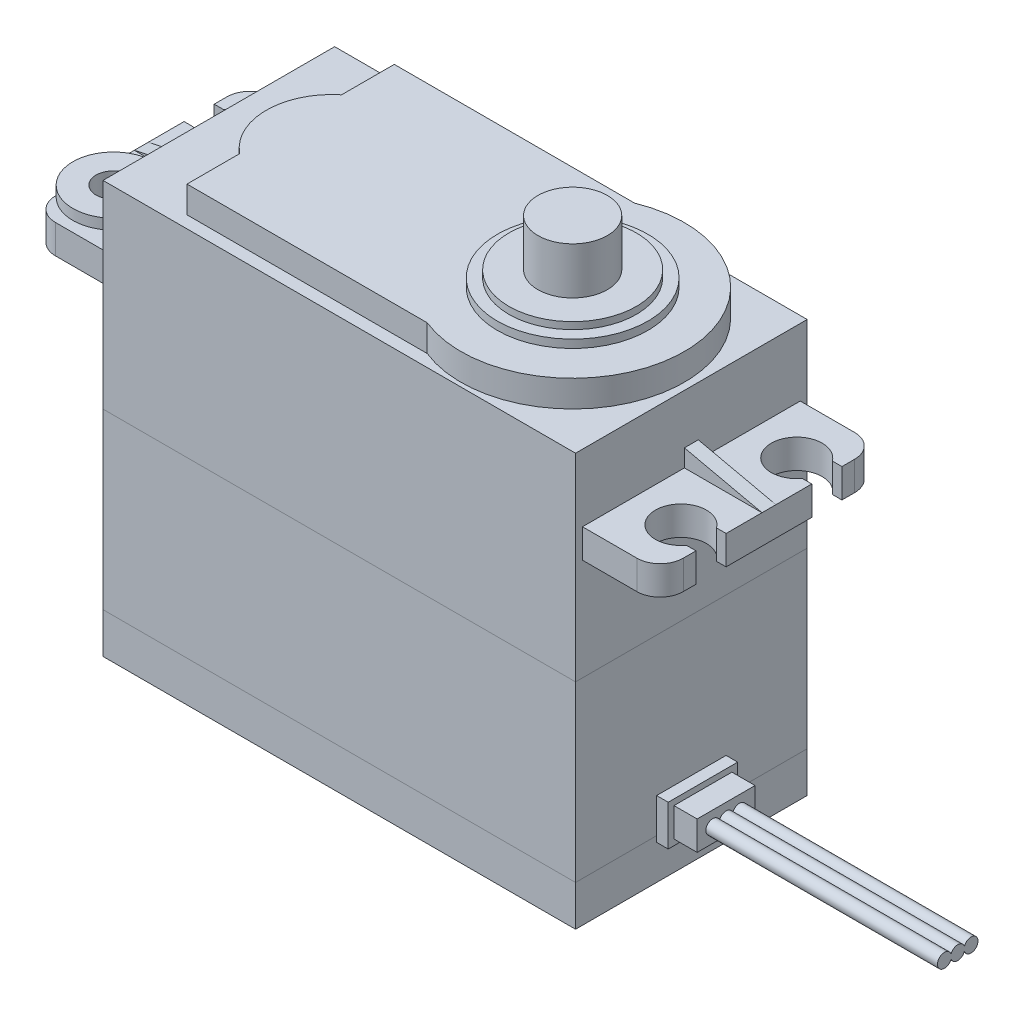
ISO-10303-21;
HEADER;
FILE_DESCRIPTION(('STEP AP214'),'2;1');
FILE_NAME('part.step','',(''),(''),'','','');
FILE_SCHEMA(('AUTOMOTIVE_DESIGN { 1 0 10303 214 1 1 1 1 }'));
ENDSEC;
DATA;
#1=APPLICATION_CONTEXT('core data for automotive mechanical design processes');
#2=APPLICATION_PROTOCOL_DEFINITION('international standard','automotive_design',2000,#1);
#3=PRODUCT_CONTEXT('',#1,'mechanical');
#4=PRODUCT('Part','Part','',(#3));
#5=PRODUCT_RELATED_PRODUCT_CATEGORY('part','',(#4));
#6=PRODUCT_DEFINITION_FORMATION('','',#4);
#7=PRODUCT_DEFINITION_CONTEXT('part definition',#1,'design');
#8=PRODUCT_DEFINITION('design','',#6,#7);
#9=PRODUCT_DEFINITION_SHAPE('','',#8);
#10=(LENGTH_UNIT() NAMED_UNIT(*) SI_UNIT(.MILLI.,.METRE.));
#11=(NAMED_UNIT(*) PLANE_ANGLE_UNIT() SI_UNIT($,.RADIAN.));
#12=(NAMED_UNIT(*) SI_UNIT($,.STERADIAN.) SOLID_ANGLE_UNIT());
#13=UNCERTAINTY_MEASURE_WITH_UNIT(LENGTH_MEASURE(1.E-05),#10,'distance_accuracy_value','');
#14=(GEOMETRIC_REPRESENTATION_CONTEXT(3) GLOBAL_UNCERTAINTY_ASSIGNED_CONTEXT((#13)) GLOBAL_UNIT_ASSIGNED_CONTEXT((#10,
#11,#12)) REPRESENTATION_CONTEXT('',''));
#15=CARTESIAN_POINT('',(0.,0.,0.));
#16=DIRECTION('',(0.,0.,1.));
#17=DIRECTION('',(1.,0.,0.));
#18=AXIS2_PLACEMENT_3D('',#15,#16,#17);
#19=CARTESIAN_POINT('',(43.4,4.75,-1.15));
#20=DIRECTION('',(-1.,0.,0.));
#21=DIRECTION('',(0.,0.,1.));
#22=AXIS2_PLACEMENT_3D('',#19,#20,#21);
#23=CYLINDRICAL_SURFACE('',#22,0.6);
#24=CARTESIAN_POINT('',(23.4,4.75,-1.15));
#25=DIRECTION('',(1.,0.,0.));
#26=DIRECTION('',(0.,0.,-1.));
#27=AXIS2_PLACEMENT_3D('',#24,#25,#26);
#28=CIRCLE('',#27,0.6);
#29=CARTESIAN_POINT('',(23.4,4.57860863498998,-0.575));
#30=VERTEX_POINT('',#29);
#31=CARTESIAN_POINT('',(23.4,4.92139136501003,-0.575));
#32=VERTEX_POINT('',#31);
#33=EDGE_CURVE('E111',#30,#32,#28,.T.);
#34=ORIENTED_EDGE('',*,*,#33,.T.);
#35=DIRECTION('',(-1.,0.,0.));
#36=VECTOR('',#35,1.);
#37=CARTESIAN_POINT('',(43.4,4.92139136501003,-0.575));
#38=LINE('',#37,#36);
#39=CARTESIAN_POINT('',(43.4,4.92139136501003,-0.575));
#40=VERTEX_POINT('',#39);
#41=EDGE_CURVE('E12',#40,#32,#38,.T.);
#42=ORIENTED_EDGE('',*,*,#41,.F.);
#43=CARTESIAN_POINT('',(43.4,4.75,-1.15));
#44=DIRECTION('',(1.,0.,0.));
#45=DIRECTION('',(0.,0.,-1.));
#46=AXIS2_PLACEMENT_3D('',#43,#44,#45);
#47=CIRCLE('',#46,0.6);
#48=CARTESIAN_POINT('',(43.4,4.57860863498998,-0.575));
#49=VERTEX_POINT('',#48);
#50=EDGE_CURVE('E99',#49,#40,#47,.T.);
#51=ORIENTED_EDGE('',*,*,#50,.F.);
#52=DIRECTION('',(-1.,0.,0.));
#53=VECTOR('',#52,1.);
#54=CARTESIAN_POINT('',(43.4,4.57860863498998,-0.575));
#55=LINE('',#54,#53);
#56=EDGE_CURVE('E107',#49,#30,#55,.T.);
#57=ORIENTED_EDGE('',*,*,#56,.T.);
#58=EDGE_LOOP('',(#34,#42,#51,#57));
#59=FACE_BOUND('',#58,.T.);
#60=ADVANCED_FACE('F48',(#59),#23,.T.);
#61=CARTESIAN_POINT('',(43.4,4.75,0.));
#62=DIRECTION('',(-1.,0.,0.));
#63=DIRECTION('',(0.,0.,1.));
#64=AXIS2_PLACEMENT_3D('',#61,#62,#63);
#65=CYLINDRICAL_SURFACE('',#64,0.6);
#66=CARTESIAN_POINT('',(23.4,4.75,0.));
#67=DIRECTION('',(1.,0.,0.));
#68=DIRECTION('',(0.,0.,-1.));
#69=AXIS2_PLACEMENT_3D('',#66,#67,#68);
#70=CIRCLE('',#69,0.6);
#71=CARTESIAN_POINT('',(23.4,4.92139136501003,0.575));
#72=VERTEX_POINT('',#71);
#73=EDGE_CURVE('E103',#32,#72,#70,.T.);
#74=ORIENTED_EDGE('',*,*,#73,.T.);
#75=DIRECTION('',(-1.,0.,0.));
#76=VECTOR('',#75,1.);
#77=CARTESIAN_POINT('',(43.4,4.92139136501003,0.575));
#78=LINE('',#77,#76);
#79=CARTESIAN_POINT('',(43.4,4.92139136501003,0.575));
#80=VERTEX_POINT('',#79);
#81=EDGE_CURVE('E56',#80,#72,#78,.T.);
#82=ORIENTED_EDGE('',*,*,#81,.F.);
#83=CARTESIAN_POINT('',(43.4,4.75,0.));
#84=DIRECTION('',(1.,0.,0.));
#85=DIRECTION('',(0.,0.,-1.));
#86=AXIS2_PLACEMENT_3D('',#83,#84,#85);
#87=CIRCLE('',#86,0.6);
#88=EDGE_CURVE('E94',#40,#80,#87,.T.);
#89=ORIENTED_EDGE('',*,*,#88,.F.);
#90=ORIENTED_EDGE('',*,*,#41,.T.);
#91=EDGE_LOOP('',(#74,#82,#89,#90));
#92=FACE_BOUND('',#91,.T.);
#93=ADVANCED_FACE('F102',(#92),#65,.T.);
#94=CARTESIAN_POINT('',(43.4,4.75,1.15));
#95=DIRECTION('',(-1.,0.,0.));
#96=DIRECTION('',(0.,0.,1.));
#97=AXIS2_PLACEMENT_3D('',#94,#95,#96);
#98=CYLINDRICAL_SURFACE('',#97,0.6);
#99=CARTESIAN_POINT('',(23.4,4.75,1.15));
#100=DIRECTION('',(1.,0.,0.));
#101=DIRECTION('',(0.,0.,-1.));
#102=AXIS2_PLACEMENT_3D('',#99,#100,#101);
#103=CIRCLE('',#102,0.6);
#104=CARTESIAN_POINT('',(23.4,4.57860863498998,0.575));
#105=VERTEX_POINT('',#104);
#106=EDGE_CURVE('E81',#72,#105,#103,.T.);
#107=ORIENTED_EDGE('',*,*,#106,.T.);
#108=DIRECTION('',(-1.,0.,0.));
#109=VECTOR('',#108,1.);
#110=CARTESIAN_POINT('',(43.4,4.57860863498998,0.575));
#111=LINE('',#110,#109);
#112=CARTESIAN_POINT('',(43.4,4.57860863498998,0.575));
#113=VERTEX_POINT('',#112);
#114=EDGE_CURVE('E104',#113,#105,#111,.T.);
#115=ORIENTED_EDGE('',*,*,#114,.F.);
#116=CARTESIAN_POINT('',(43.4,4.75,1.15));
#117=DIRECTION('',(1.,0.,0.));
#118=DIRECTION('',(0.,0.,-1.));
#119=AXIS2_PLACEMENT_3D('',#116,#117,#118);
#120=CIRCLE('',#119,0.6);
#121=EDGE_CURVE('E97',#80,#113,#120,.T.);
#122=ORIENTED_EDGE('',*,*,#121,.F.);
#123=ORIENTED_EDGE('',*,*,#81,.T.);
#124=EDGE_LOOP('',(#107,#115,#122,#123));
#125=FACE_BOUND('',#124,.T.);
#126=ADVANCED_FACE('F105',(#125),#98,.T.);
#127=CARTESIAN_POINT('',(43.4,4.75,0.));
#128=DIRECTION('',(-1.,0.,0.));
#129=DIRECTION('',(0.,0.,1.));
#130=AXIS2_PLACEMENT_3D('',#127,#128,#129);
#131=CYLINDRICAL_SURFACE('',#130,0.6);
#132=CARTESIAN_POINT('',(23.4,4.75,0.));
#133=DIRECTION('',(1.,0.,0.));
#134=DIRECTION('',(0.,0.,-1.));
#135=AXIS2_PLACEMENT_3D('',#132,#133,#134);
#136=CIRCLE('',#135,0.6);
#137=EDGE_CURVE('E87',#105,#30,#136,.T.);
#138=ORIENTED_EDGE('',*,*,#137,.T.);
#139=ORIENTED_EDGE('',*,*,#56,.F.);
#140=CARTESIAN_POINT('',(43.4,4.75,0.));
#141=DIRECTION('',(1.,0.,0.));
#142=DIRECTION('',(0.,0.,-1.));
#143=AXIS2_PLACEMENT_3D('',#140,#141,#142);
#144=CIRCLE('',#143,0.6);
#145=EDGE_CURVE('E64',#113,#49,#144,.T.);
#146=ORIENTED_EDGE('',*,*,#145,.F.);
#147=ORIENTED_EDGE('',*,*,#114,.T.);
#148=EDGE_LOOP('',(#138,#139,#146,#147));
#149=FACE_BOUND('',#148,.T.);
#150=ADVANCED_FACE('F118',(#149),#131,.T.);
#151=CARTESIAN_POINT('',(43.4,4.75,-0.575));
#152=DIRECTION('',(1.,0.,0.));
#153=DIRECTION('',(0.,0.,-1.));
#154=AXIS2_PLACEMENT_3D('',#151,#152,#153);
#155=PLANE('',#154);
#156=ORIENTED_EDGE('',*,*,#50,.T.);
#157=ORIENTED_EDGE('',*,*,#88,.T.);
#158=ORIENTED_EDGE('',*,*,#121,.T.);
#159=ORIENTED_EDGE('',*,*,#145,.T.);
#160=EDGE_LOOP('',(#156,#157,#158,#159));
#161=FACE_BOUND('',#160,.T.);
#162=ADVANCED_FACE('F95',(#161),#155,.T.);
#163=CARTESIAN_POINT('',(23.4,4.75,-0.575));
#164=DIRECTION('',(1.,0.,0.));
#165=DIRECTION('',(0.,0.,-1.));
#166=AXIS2_PLACEMENT_3D('',#163,#164,#165);
#167=PLANE('',#166);
#168=ORIENTED_EDGE('',*,*,#33,.F.);
#169=ORIENTED_EDGE('',*,*,#137,.F.);
#170=ORIENTED_EDGE('',*,*,#106,.F.);
#171=ORIENTED_EDGE('',*,*,#73,.F.);
#172=EDGE_LOOP('',(#168,#169,#170,#171));
#173=FACE_BOUND('',#172,.T.);
#174=ADVANCED_FACE('F121',(#173),#167,.F.);
#175=CLOSED_SHELL('',(#60,#93,#126,#150,#162,#174));
#176=MANIFOLD_SOLID_BREP('B2',#175);
#177=CARTESIAN_POINT('',(10.15,94.9852813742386,0.));
#178=DIRECTION('',(0.,-1.,0.));
#179=DIRECTION('',(0.,0.,-1.));
#180=AXIS2_PLACEMENT_3D('',#177,#178,#179);
#181=CYLINDRICAL_SURFACE('',#180,3.);
#182=CARTESIAN_POINT('',(10.15,39.2,0.));
#183=DIRECTION('',(0.,1.,0.));
#184=DIRECTION('',(0.,0.,1.));
#185=AXIS2_PLACEMENT_3D('',#182,#183,#184);
#186=CIRCLE('',#185,3.);
#187=CARTESIAN_POINT('',(10.15,39.2,3.));
#188=VERTEX_POINT('',#187);
#189=EDGE_CURVE('E197',#188,#188,#186,.T.);
#190=ORIENTED_EDGE('',*,*,#189,.T.);
#191=EDGE_LOOP('',(#190));
#192=FACE_BOUND('',#191,.T.);
#193=CARTESIAN_POINT('',(10.15,43.25,0.));
#194=DIRECTION('',(0.,1.,0.));
#195=DIRECTION('',(0.,0.,1.));
#196=AXIS2_PLACEMENT_3D('',#193,#194,#195);
#197=CIRCLE('',#196,3.);
#198=CARTESIAN_POINT('',(10.15,43.25,3.));
#199=VERTEX_POINT('',#198);
#200=EDGE_CURVE('E47',#199,#199,#197,.T.);
#201=ORIENTED_EDGE('',*,*,#200,.F.);
#202=EDGE_LOOP('',(#201));
#203=FACE_BOUND('',#202,.T.);
#204=ADVANCED_FACE('F190',(#192,#203),#181,.T.);
#205=CARTESIAN_POINT('',(10.15,39.2,0.));
#206=DIRECTION('',(0.,1.,0.));
#207=DIRECTION('',(0.,0.,1.));
#208=AXIS2_PLACEMENT_3D('',#205,#206,#207);
#209=PLANE('',#208);
#210=ORIENTED_EDGE('',*,*,#189,.F.);
#211=EDGE_LOOP('',(#210));
#212=FACE_BOUND('',#211,.T.);
#213=ADVANCED_FACE('F205',(#212),#209,.F.);
#214=CARTESIAN_POINT('',(0.,43.25,0.));
#215=DIRECTION('',(0.,1.,0.));
#216=DIRECTION('',(0.,0.,1.));
#217=AXIS2_PLACEMENT_3D('',#214,#215,#216);
#218=PLANE('',#217);
#219=ORIENTED_EDGE('',*,*,#200,.T.);
#220=EDGE_LOOP('',(#219));
#221=FACE_BOUND('',#220,.T.);
#222=ADVANCED_FACE('F192',(#221),#218,.T.);
#223=CLOSED_SHELL('',(#204,#213,#222));
#224=MANIFOLD_SOLID_BREP('B6',#223);
#225=CARTESIAN_POINT('',(21.4,0.,0.));
#226=DIRECTION('',(1.,0.,0.));
#227=DIRECTION('',(0.,0.,-1.));
#228=AXIS2_PLACEMENT_3D('',#225,#226,#227);
#229=PLANE('',#228);
#230=DIRECTION('',(0.,-1.,0.));
#231=VECTOR('',#230,1.);
#232=CARTESIAN_POINT('',(21.4,6.5,3.));
#233=LINE('',#232,#231);
#234=CARTESIAN_POINT('',(21.4,6.5,3.));
#235=VERTEX_POINT('',#234);
#236=CARTESIAN_POINT('',(21.4,3.,3.));
#237=VERTEX_POINT('',#236);
#238=EDGE_CURVE('E635',#235,#237,#233,.T.);
#239=ORIENTED_EDGE('',*,*,#238,.T.);
#240=DIRECTION('',(0.,0.,-1.));
#241=VECTOR('',#240,1.);
#242=CARTESIAN_POINT('',(21.4,3.,3.));
#243=LINE('',#242,#241);
#244=CARTESIAN_POINT('',(21.4,3.,-3.));
#245=VERTEX_POINT('',#244);
#246=EDGE_CURVE('E638',#237,#245,#243,.T.);
#247=ORIENTED_EDGE('',*,*,#246,.T.);
#248=DIRECTION('',(0.,1.,0.));
#249=VECTOR('',#248,1.);
#250=CARTESIAN_POINT('',(21.4,6.5,-3.));
#251=LINE('',#250,#249);
#252=CARTESIAN_POINT('',(21.4,6.5,-3.));
#253=VERTEX_POINT('',#252);
#254=EDGE_CURVE('E641',#245,#253,#251,.T.);
#255=ORIENTED_EDGE('',*,*,#254,.T.);
#256=DIRECTION('',(0.,0.,1.));
#257=VECTOR('',#256,1.);
#258=CARTESIAN_POINT('',(21.4,6.5,3.));
#259=LINE('',#258,#257);
#260=EDGE_CURVE('E643',#253,#235,#259,.T.);
#261=ORIENTED_EDGE('',*,*,#260,.T.);
#262=EDGE_LOOP('',(#239,#247,#255,#261));
#263=FACE_BOUND('',#262,.T.);
#264=DIRECTION('',(0.,-1.,0.));
#265=VECTOR('',#264,1.);
#266=CARTESIAN_POINT('',(21.4,6.,2.5));
#267=LINE('',#266,#265);
#268=CARTESIAN_POINT('',(21.4,6.,2.5));
#269=VERTEX_POINT('',#268);
#270=CARTESIAN_POINT('',(21.4,3.5,2.5));
#271=VERTEX_POINT('',#270);
#272=EDGE_CURVE('E2055',#269,#271,#267,.T.);
#273=ORIENTED_EDGE('',*,*,#272,.F.);
#274=DIRECTION('',(0.,0.,1.));
#275=VECTOR('',#274,1.);
#276=CARTESIAN_POINT('',(21.4,6.,-2.5));
#277=LINE('',#276,#275);
#278=CARTESIAN_POINT('',(21.4,6.,-2.5));
#279=VERTEX_POINT('',#278);
#280=EDGE_CURVE('E626',#279,#269,#277,.T.);
#281=ORIENTED_EDGE('',*,*,#280,.F.);
#282=DIRECTION('',(0.,1.,0.));
#283=VECTOR('',#282,1.);
#284=CARTESIAN_POINT('',(21.4,3.5,-2.5));
#285=LINE('',#284,#283);
#286=CARTESIAN_POINT('',(21.4,3.5,-2.5));
#287=VERTEX_POINT('',#286);
#288=EDGE_CURVE('E622',#287,#279,#285,.T.);
#289=ORIENTED_EDGE('',*,*,#288,.F.);
#290=DIRECTION('',(0.,0.,-1.));
#291=VECTOR('',#290,1.);
#292=CARTESIAN_POINT('',(21.4,3.5,2.5));
#293=LINE('',#292,#291);
#294=EDGE_CURVE('E2052',#271,#287,#293,.T.);
#295=ORIENTED_EDGE('',*,*,#294,.F.);
#296=EDGE_LOOP('',(#273,#281,#289,#295));
#297=FACE_BOUND('',#296,.T.);
#298=ADVANCED_FACE('F232',(#263,#297),#229,.T.);
#299=CARTESIAN_POINT('',(20.4,35.6,-10.));
#300=DIRECTION('',(-1.,0.,0.));
#301=DIRECTION('',(0.,0.,1.));
#302=AXIS2_PLACEMENT_3D('',#299,#300,#301);
#303=PLANE('',#302);
#304=DIRECTION('',(0.,-1.,0.));
#305=VECTOR('',#304,1.);
#306=CARTESIAN_POINT('',(20.4,6.5,3.));
#307=LINE('',#306,#305);
#308=CARTESIAN_POINT('',(20.4,3.5,3.));
#309=VERTEX_POINT('',#308);
#310=CARTESIAN_POINT('',(20.4,3.00000000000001,3.));
#311=VERTEX_POINT('',#310);
#312=EDGE_CURVE('E628',#309,#311,#307,.T.);
#313=ORIENTED_EDGE('',*,*,#312,.F.);
#314=DIRECTION('',(0.,0.,-1.));
#315=VECTOR('',#314,1.);
#316=CARTESIAN_POINT('',(20.4,3.5,-10.));
#317=LINE('',#316,#315);
#318=CARTESIAN_POINT('',(20.4,3.5,10.));
#319=VERTEX_POINT('',#318);
#320=EDGE_CURVE('E1049',#319,#309,#317,.T.);
#321=ORIENTED_EDGE('',*,*,#320,.F.);
#322=DIRECTION('',(0.,-1.,0.));
#323=VECTOR('',#322,1.);
#324=CARTESIAN_POINT('',(20.4,35.6,10.));
#325=LINE('',#324,#323);
#326=CARTESIAN_POINT('',(20.4,0.,10.));
#327=VERTEX_POINT('',#326);
#328=EDGE_CURVE('E977',#319,#327,#325,.T.);
#329=ORIENTED_EDGE('',*,*,#328,.T.);
#330=DIRECTION('',(0.,0.,-1.));
#331=VECTOR('',#330,1.);
#332=CARTESIAN_POINT('',(20.4,0.,-10.));
#333=LINE('',#332,#331);
#334=CARTESIAN_POINT('',(20.4,0.,-10.));
#335=VERTEX_POINT('',#334);
#336=EDGE_CURVE('E953',#327,#335,#333,.T.);
#337=ORIENTED_EDGE('',*,*,#336,.T.);
#338=DIRECTION('',(0.,-1.,0.));
#339=VECTOR('',#338,1.);
#340=CARTESIAN_POINT('',(20.4,35.6,-10.));
#341=LINE('',#340,#339);
#342=CARTESIAN_POINT('',(20.4,3.5,-10.));
#343=VERTEX_POINT('',#342);
#344=EDGE_CURVE('E1001',#343,#335,#341,.T.);
#345=ORIENTED_EDGE('',*,*,#344,.F.);
#346=CARTESIAN_POINT('',(20.4,3.5,-3.));
#347=VERTEX_POINT('',#346);
#348=EDGE_CURVE('E1047',#347,#343,#317,.T.);
#349=ORIENTED_EDGE('',*,*,#348,.F.);
#350=DIRECTION('',(0.,1.,0.));
#351=VECTOR('',#350,1.);
#352=CARTESIAN_POINT('',(20.4,6.5,-3.));
#353=LINE('',#352,#351);
#354=CARTESIAN_POINT('',(20.4,3.,-3.));
#355=VERTEX_POINT('',#354);
#356=EDGE_CURVE('E648',#355,#347,#353,.T.);
#357=ORIENTED_EDGE('',*,*,#356,.F.);
#358=DIRECTION('',(0.,0.,-1.));
#359=VECTOR('',#358,1.);
#360=CARTESIAN_POINT('',(20.4,3.,3.));
#361=LINE('',#360,#359);
#362=EDGE_CURVE('E255',#311,#355,#361,.T.);
#363=ORIENTED_EDGE('',*,*,#362,.F.);
#364=EDGE_LOOP('',(#313,#321,#329,#337,#345,#349,#357,#363));
#365=FACE_BOUND('',#364,.T.);
#366=ADVANCED_FACE('F1185',(#365),#303,.F.);
#367=CARTESIAN_POINT('',(20.4,6.5,3.));
#368=VERTEX_POINT('',#367);
#369=EDGE_CURVE('E630',#368,#309,#307,.T.);
#370=ORIENTED_EDGE('',*,*,#369,.F.);
#371=DIRECTION('',(0.,0.,1.));
#372=VECTOR('',#371,1.);
#373=CARTESIAN_POINT('',(20.4,6.5,3.));
#374=LINE('',#373,#372);
#375=CARTESIAN_POINT('',(20.4,6.5,-3.));
#376=VERTEX_POINT('',#375);
#377=EDGE_CURVE('E639',#376,#368,#374,.T.);
#378=ORIENTED_EDGE('',*,*,#377,.F.);
#379=DIRECTION('',(0.,1.,0.));
#380=VECTOR('',#379,1.);
#381=CARTESIAN_POINT('',(20.4,35.6,-3.00000000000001));
#382=LINE('',#381,#380);
#383=EDGE_CURVE('E188',#347,#376,#382,.T.);
#384=ORIENTED_EDGE('',*,*,#383,.F.);
#385=ORIENTED_EDGE('',*,*,#348,.T.);
#386=CARTESIAN_POINT('',(20.4,18.5,-10.));
#387=VERTEX_POINT('',#386);
#388=EDGE_CURVE('E1007',#387,#343,#341,.T.);
#389=ORIENTED_EDGE('',*,*,#388,.F.);
#390=DIRECTION('',(0.,0.,1.));
#391=VECTOR('',#390,1.);
#392=CARTESIAN_POINT('',(20.4,18.5,-10.));
#393=LINE('',#392,#391);
#394=CARTESIAN_POINT('',(20.4,18.5,10.));
#395=VERTEX_POINT('',#394);
#396=EDGE_CURVE('E1044',#387,#395,#393,.T.);
#397=ORIENTED_EDGE('',*,*,#396,.T.);
#398=EDGE_CURVE('E992',#395,#319,#325,.T.);
#399=ORIENTED_EDGE('',*,*,#398,.T.);
#400=ORIENTED_EDGE('',*,*,#320,.T.);
#401=EDGE_LOOP('',(#370,#378,#384,#385,#389,#397,#399,#400));
#402=FACE_BOUND('',#401,.T.);
#403=ADVANCED_FACE('F1191',(#402),#303,.F.);
#404=CARTESIAN_POINT('',(-24.5,29.8,-5.));
#405=DIRECTION('',(0.,-1.,0.));
#406=DIRECTION('',(0.,0.,-1.));
#407=AXIS2_PLACEMENT_3D('',#404,#405,#406);
#408=PLANE('',#407);
#409=CARTESIAN_POINT('',(-24.5,29.8,5.));
#410=DIRECTION('',(0.,-1.,0.));
#411=DIRECTION('',(0.,0.,-1.));
#412=AXIS2_PLACEMENT_3D('',#409,#410,#411);
#413=CIRCLE('',#412,3.5);
#414=CARTESIAN_POINT('',(-27.1,29.8,2.656925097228));
#415=VERTEX_POINT('',#414);
#416=CARTESIAN_POINT('',(-27.1,29.8,7.343074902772));
#417=VERTEX_POINT('',#416);
#418=EDGE_CURVE('E685',#415,#417,#413,.T.);
#419=ORIENTED_EDGE('',*,*,#418,.T.);
#420=DIRECTION('',(0.,0.,-1.));
#421=VECTOR('',#420,1.);
#422=CARTESIAN_POINT('',(-27.1,29.8,6.3));
#423=LINE('',#422,#421);
#424=CARTESIAN_POINT('',(-27.1,29.8,7.4));
#425=VERTEX_POINT('',#424);
#426=EDGE_CURVE('E834',#425,#417,#423,.T.);
#427=ORIENTED_EDGE('',*,*,#426,.F.);
#428=CARTESIAN_POINT('',(-25.1,29.8,7.4));
#429=DIRECTION('',(0.,-1.,0.));
#430=DIRECTION('',(0.,0.,-1.));
#431=AXIS2_PLACEMENT_3D('',#428,#429,#430);
#432=CIRCLE('',#431,2.);
#433=CARTESIAN_POINT('',(-25.1,29.8,9.4));
#434=VERTEX_POINT('',#433);
#435=EDGE_CURVE('E1041',#425,#434,#432,.F.);
#436=ORIENTED_EDGE('',*,*,#435,.T.);
#437=DIRECTION('',(-1.,0.,0.));
#438=VECTOR('',#437,1.);
#439=CARTESIAN_POINT('',(-27.1,29.8,9.4));
#440=LINE('',#439,#438);
#441=CARTESIAN_POINT('',(-20.4,29.8,9.4));
#442=VERTEX_POINT('',#441);
#443=EDGE_CURVE('E831',#442,#434,#440,.T.);
#444=ORIENTED_EDGE('',*,*,#443,.F.);
#445=DIRECTION('',(0.,0.,1.));
#446=VECTOR('',#445,1.);
#447=CARTESIAN_POINT('',(-20.4,29.8,-9.4));
#448=LINE('',#447,#446);
#449=CARTESIAN_POINT('',(-20.4,29.8,0.6));
#450=VERTEX_POINT('',#449);
#451=EDGE_CURVE('E827',#450,#442,#448,.T.);
#452=ORIENTED_EDGE('',*,*,#451,.F.);
#453=DIRECTION('',(1.,0.,0.));
#454=VECTOR('',#453,1.);
#455=CARTESIAN_POINT('',(-27.1,29.8,0.6));
#456=LINE('',#455,#454);
#457=CARTESIAN_POINT('',(-27.1,29.8,0.6));
#458=VERTEX_POINT('',#457);
#459=EDGE_CURVE('E803',#458,#450,#456,.T.);
#460=ORIENTED_EDGE('',*,*,#459,.F.);
#461=DIRECTION('',(0.,0.,-1.));
#462=VECTOR('',#461,1.);
#463=CARTESIAN_POINT('',(-27.1,29.8,-3.7));
#464=LINE('',#463,#462);
#465=EDGE_CURVE('E848',#415,#458,#464,.T.);
#466=ORIENTED_EDGE('',*,*,#465,.F.);
#467=EDGE_LOOP('',(#419,#427,#436,#444,#452,#460,#466));
#468=FACE_BOUND('',#467,.T.);
#469=ADVANCED_FACE('F1135',(#468),#408,.F.);
#470=CARTESIAN_POINT('',(-24.5,27.3,-5.));
#471=DIRECTION('',(0.,-1.,0.));
#472=DIRECTION('',(0.,0.,-1.));
#473=AXIS2_PLACEMENT_3D('',#470,#471,#472);
#474=PLANE('',#473);
#475=DIRECTION('',(0.,0.,-1.));
#476=VECTOR('',#475,1.);
#477=CARTESIAN_POINT('',(-27.1,27.3,6.3));
#478=LINE('',#477,#476);
#479=CARTESIAN_POINT('',(-27.1,27.3,7.4));
#480=VERTEX_POINT('',#479);
#481=CARTESIAN_POINT('',(-27.1,27.3,7.343074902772));
#482=VERTEX_POINT('',#481);
#483=EDGE_CURVE('E864',#480,#482,#478,.T.);
#484=ORIENTED_EDGE('',*,*,#483,.T.);
#485=CARTESIAN_POINT('',(-24.5,27.3,5.));
#486=DIRECTION('',(0.,-1.,0.));
#487=DIRECTION('',(0.,0.,-1.));
#488=AXIS2_PLACEMENT_3D('',#485,#486,#487);
#489=CIRCLE('',#488,3.5);
#490=CARTESIAN_POINT('',(-27.1,27.3,2.656925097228));
#491=VERTEX_POINT('',#490);
#492=EDGE_CURVE('E670',#491,#482,#489,.T.);
#493=ORIENTED_EDGE('',*,*,#492,.F.);
#494=DIRECTION('',(0.,0.,-1.));
#495=VECTOR('',#494,1.);
#496=CARTESIAN_POINT('',(-27.1,27.3,-3.7));
#497=LINE('',#496,#495);
#498=CARTESIAN_POINT('',(-27.1,27.3,-3.7));
#499=VERTEX_POINT('',#498);
#500=EDGE_CURVE('E871',#491,#499,#497,.T.);
#501=ORIENTED_EDGE('',*,*,#500,.T.);
#502=DIRECTION('',(1.,0.,0.));
#503=VECTOR('',#502,1.);
#504=CARTESIAN_POINT('',(-26.2124543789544,27.3,-3.7));
#505=LINE('',#504,#503);
#506=CARTESIAN_POINT('',(-26.2748239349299,27.3,-3.7));
#507=VERTEX_POINT('',#506);
#508=EDGE_CURVE('E875',#499,#507,#505,.T.);
#509=ORIENTED_EDGE('',*,*,#508,.T.);
#510=CARTESIAN_POINT('',(-24.5,27.3,-5.));
#511=DIRECTION('',(0.,-1.,0.));
#512=DIRECTION('',(0.,0.,-1.));
#513=AXIS2_PLACEMENT_3D('',#510,#511,#512);
#514=CIRCLE('',#513,2.19999999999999);
#515=CARTESIAN_POINT('',(-26.2748239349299,27.3,-6.3));
#516=VERTEX_POINT('',#515);
#517=EDGE_CURVE('E240',#516,#507,#514,.T.);
#518=ORIENTED_EDGE('',*,*,#517,.F.);
#519=DIRECTION('',(-1.,0.,0.));
#520=VECTOR('',#519,1.);
#521=CARTESIAN_POINT('',(-26.2124543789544,27.3,-6.3));
#522=LINE('',#521,#520);
#523=CARTESIAN_POINT('',(-27.1,27.3,-6.3));
#524=VERTEX_POINT('',#523);
#525=EDGE_CURVE('E825',#516,#524,#522,.T.);
#526=ORIENTED_EDGE('',*,*,#525,.T.);
#527=DIRECTION('',(0.,0.,-1.));
#528=VECTOR('',#527,1.);
#529=CARTESIAN_POINT('',(-27.1,27.3,-9.4));
#530=LINE('',#529,#528);
#531=CARTESIAN_POINT('',(-27.1,27.3,-7.4));
#532=VERTEX_POINT('',#531);
#533=EDGE_CURVE('E820',#524,#532,#530,.T.);
#534=ORIENTED_EDGE('',*,*,#533,.T.);
#535=CARTESIAN_POINT('',(-25.1,27.3,-7.4));
#536=DIRECTION('',(0.,-1.,0.));
#537=DIRECTION('',(0.,0.,-1.));
#538=AXIS2_PLACEMENT_3D('',#535,#536,#537);
#539=CIRCLE('',#538,2.);
#540=CARTESIAN_POINT('',(-25.1,27.3,-9.4));
#541=VERTEX_POINT('',#540);
#542=EDGE_CURVE('E1030',#532,#541,#539,.T.);
#543=ORIENTED_EDGE('',*,*,#542,.T.);
#544=DIRECTION('',(1.,0.,0.));
#545=VECTOR('',#544,1.);
#546=CARTESIAN_POINT('',(-27.1,27.3,-9.4));
#547=LINE('',#546,#545);
#548=CARTESIAN_POINT('',(-20.4,27.3,-9.4));
#549=VERTEX_POINT('',#548);
#550=EDGE_CURVE('E856',#541,#549,#547,.T.);
#551=ORIENTED_EDGE('',*,*,#550,.T.);
#552=DIRECTION('',(0.,0.,1.));
#553=VECTOR('',#552,1.);
#554=CARTESIAN_POINT('',(-20.4,27.3,-9.4));
#555=LINE('',#554,#553);
#556=CARTESIAN_POINT('',(-20.4,27.3,9.4));
#557=VERTEX_POINT('',#556);
#558=EDGE_CURVE('E858',#549,#557,#555,.T.);
#559=ORIENTED_EDGE('',*,*,#558,.T.);
#560=DIRECTION('',(-1.,0.,0.));
#561=VECTOR('',#560,1.);
#562=CARTESIAN_POINT('',(-27.1,27.3,9.4));
#563=LINE('',#562,#561);
#564=CARTESIAN_POINT('',(-25.1,27.3,9.4));
#565=VERTEX_POINT('',#564);
#566=EDGE_CURVE('E861',#557,#565,#563,.T.);
#567=ORIENTED_EDGE('',*,*,#566,.T.);
#568=CARTESIAN_POINT('',(-25.1,27.3,7.4));
#569=DIRECTION('',(0.,-1.,0.));
#570=DIRECTION('',(0.,0.,-1.));
#571=AXIS2_PLACEMENT_3D('',#568,#569,#570);
#572=CIRCLE('',#571,2.);
#573=EDGE_CURVE('E1028',#565,#480,#572,.T.);
#574=ORIENTED_EDGE('',*,*,#573,.T.);
#575=EDGE_LOOP('',(#484,#493,#501,#509,#518,#526,#534,#543,#551,#559,#567,#574));
#576=FACE_BOUND('',#575,.T.);
#577=ADVANCED_FACE('F1088',(#576),#474,.T.);
#578=CARTESIAN_POINT('',(-20.4,35.6,-10.));
#579=DIRECTION('',(1.,0.,0.));
#580=DIRECTION('',(0.,0.,-1.));
#581=AXIS2_PLACEMENT_3D('',#578,#579,#580);
#582=PLANE('',#581);
#583=DIRECTION('',(0.,0.,1.));
#584=VECTOR('',#583,1.);
#585=CARTESIAN_POINT('',(-20.4,3.5,-10.));
#586=LINE('',#585,#584);
#587=CARTESIAN_POINT('',(-20.4,3.5,-10.));
#588=VERTEX_POINT('',#587);
#589=CARTESIAN_POINT('',(-20.4,3.5,10.));
#590=VERTEX_POINT('',#589);
#591=EDGE_CURVE('E1057',#588,#590,#586,.T.);
#592=ORIENTED_EDGE('',*,*,#591,.F.);
#593=DIRECTION('',(0.,-1.,0.));
#594=VECTOR('',#593,1.);
#595=CARTESIAN_POINT('',(-20.4,35.6,-10.));
#596=LINE('',#595,#594);
#597=CARTESIAN_POINT('',(-20.4,0.,-10.));
#598=VERTEX_POINT('',#597);
#599=EDGE_CURVE('E996',#588,#598,#596,.T.);
#600=ORIENTED_EDGE('',*,*,#599,.T.);
#601=DIRECTION('',(0.,0.,1.));
#602=VECTOR('',#601,1.);
#603=CARTESIAN_POINT('',(-20.4,0.,-10.));
#604=LINE('',#603,#602);
#605=CARTESIAN_POINT('',(-20.4,0.,10.));
#606=VERTEX_POINT('',#605);
#607=EDGE_CURVE('E983',#598,#606,#604,.T.);
#608=ORIENTED_EDGE('',*,*,#607,.T.);
#609=DIRECTION('',(0.,-1.,0.));
#610=VECTOR('',#609,1.);
#611=CARTESIAN_POINT('',(-20.4,35.6,10.));
#612=LINE('',#611,#610);
#613=EDGE_CURVE('E991',#590,#606,#612,.T.);
#614=ORIENTED_EDGE('',*,*,#613,.F.);
#615=EDGE_LOOP('',(#592,#600,#608,#614));
#616=FACE_BOUND('',#615,.T.);
#617=ADVANCED_FACE('F1409',(#616),#582,.F.);
#618=DIRECTION('',(0.,1.,0.));
#619=VECTOR('',#618,1.);
#620=CARTESIAN_POINT('',(-20.4,29.8,0.6));
#621=LINE('',#620,#619);
#622=CARTESIAN_POINT('',(-20.4,31.3,0.6));
#623=VERTEX_POINT('',#622);
#624=EDGE_CURVE('E806',#450,#623,#621,.T.);
#625=ORIENTED_EDGE('',*,*,#624,.F.);
#626=ORIENTED_EDGE('',*,*,#451,.T.);
#627=DIRECTION('',(0.,-1.,0.));
#628=VECTOR('',#627,1.);
#629=CARTESIAN_POINT('',(-20.4,29.8,9.4));
#630=LINE('',#629,#628);
#631=EDGE_CURVE('E892',#442,#557,#630,.T.);
#632=ORIENTED_EDGE('',*,*,#631,.T.);
#633=ORIENTED_EDGE('',*,*,#558,.F.);
#634=DIRECTION('',(0.,-1.,0.));
#635=VECTOR('',#634,1.);
#636=CARTESIAN_POINT('',(-20.4,29.8,-9.4));
#637=LINE('',#636,#635);
#638=CARTESIAN_POINT('',(-20.4,29.8,-9.4));
#639=VERTEX_POINT('',#638);
#640=EDGE_CURVE('E853',#639,#549,#637,.T.);
#641=ORIENTED_EDGE('',*,*,#640,.F.);
#642=CARTESIAN_POINT('',(-20.4,29.8,-0.6));
#643=VERTEX_POINT('',#642);
#644=EDGE_CURVE('E828',#639,#643,#448,.T.);
#645=ORIENTED_EDGE('',*,*,#644,.T.);
#646=DIRECTION('',(0.,1.,0.));
#647=VECTOR('',#646,1.);
#648=CARTESIAN_POINT('',(-20.4,29.8,-0.6));
#649=LINE('',#648,#647);
#650=CARTESIAN_POINT('',(-20.4,31.3,-0.6));
#651=VERTEX_POINT('',#650);
#652=EDGE_CURVE('E804',#643,#651,#649,.T.);
#653=ORIENTED_EDGE('',*,*,#652,.T.);
#654=DIRECTION('',(0.,0.,-1.));
#655=VECTOR('',#654,1.);
#656=CARTESIAN_POINT('',(-20.4,31.3,0.6));
#657=LINE('',#656,#655);
#658=EDGE_CURVE('E808',#623,#651,#657,.T.);
#659=ORIENTED_EDGE('',*,*,#658,.F.);
#660=EDGE_LOOP('',(#625,#626,#632,#633,#641,#645,#653,#659));
#661=FACE_BOUND('',#660,.T.);
#662=DIRECTION('',(0.,0.,-1.));
#663=VECTOR('',#662,1.);
#664=CARTESIAN_POINT('',(-20.4,18.5,-10.));
#665=LINE('',#664,#663);
#666=CARTESIAN_POINT('',(-20.4,18.5,10.));
#667=VERTEX_POINT('',#666);
#668=CARTESIAN_POINT('',(-20.4,18.5,-10.));
#669=VERTEX_POINT('',#668);
#670=EDGE_CURVE('E1054',#667,#669,#665,.T.);
#671=ORIENTED_EDGE('',*,*,#670,.F.);
#672=CARTESIAN_POINT('',(-20.4,35.6,10.));
#673=VERTEX_POINT('',#672);
#674=EDGE_CURVE('E993',#673,#667,#612,.T.);
#675=ORIENTED_EDGE('',*,*,#674,.F.);
#676=DIRECTION('',(0.,0.,1.));
#677=VECTOR('',#676,1.);
#678=CARTESIAN_POINT('',(-20.4,35.6,-10.));
#679=LINE('',#678,#677);
#680=CARTESIAN_POINT('',(-20.4,35.6,-10.));
#681=VERTEX_POINT('',#680);
#682=EDGE_CURVE('E973',#681,#673,#679,.T.);
#683=ORIENTED_EDGE('',*,*,#682,.F.);
#684=EDGE_CURVE('E998',#681,#669,#596,.T.);
#685=ORIENTED_EDGE('',*,*,#684,.T.);
#686=EDGE_LOOP('',(#671,#675,#683,#685));
#687=FACE_BOUND('',#686,.T.);
#688=ADVANCED_FACE('F1119',(#661,#687),#582,.F.);
#689=CARTESIAN_POINT('',(-20.4,35.6,-10.));
#690=DIRECTION('',(0.,0.,1.));
#691=DIRECTION('',(1.,0.,0.));
#692=AXIS2_PLACEMENT_3D('',#689,#690,#691);
#693=PLANE('',#692);
#694=DIRECTION('',(-1.,0.,0.));
#695=VECTOR('',#694,1.);
#696=CARTESIAN_POINT('',(-20.4,3.5,-10.));
#697=LINE('',#696,#695);
#698=EDGE_CURVE('E1058',#343,#588,#697,.T.);
#699=ORIENTED_EDGE('',*,*,#698,.F.);
#700=ORIENTED_EDGE('',*,*,#344,.T.);
#701=DIRECTION('',(-1.,0.,0.));
#702=VECTOR('',#701,1.);
#703=CARTESIAN_POINT('',(-20.4,0.,-10.));
#704=LINE('',#703,#702);
#705=EDGE_CURVE('E980',#335,#598,#704,.T.);
#706=ORIENTED_EDGE('',*,*,#705,.T.);
#707=ORIENTED_EDGE('',*,*,#599,.F.);
#708=EDGE_LOOP('',(#699,#700,#706,#707));
#709=FACE_BOUND('',#708,.T.);
#710=ADVANCED_FACE('F1412',(#709),#693,.F.);
#711=DIRECTION('',(1.,0.,0.));
#712=VECTOR('',#711,1.);
#713=CARTESIAN_POINT('',(-20.4,18.5,-10.));
#714=LINE('',#713,#712);
#715=EDGE_CURVE('E1053',#669,#387,#714,.T.);
#716=ORIENTED_EDGE('',*,*,#715,.F.);
#717=ORIENTED_EDGE('',*,*,#684,.F.);
#718=DIRECTION('',(-1.,0.,0.));
#719=VECTOR('',#718,1.);
#720=CARTESIAN_POINT('',(-20.4,35.6,-10.));
#721=LINE('',#720,#719);
#722=CARTESIAN_POINT('',(20.4,35.6,-10.));
#723=VERTEX_POINT('',#722);
#724=EDGE_CURVE('E970',#723,#681,#721,.T.);
#725=ORIENTED_EDGE('',*,*,#724,.F.);
#726=EDGE_CURVE('E1003',#723,#387,#341,.T.);
#727=ORIENTED_EDGE('',*,*,#726,.T.);
#728=EDGE_LOOP('',(#716,#717,#725,#727));
#729=FACE_BOUND('',#728,.T.);
#730=ADVANCED_FACE('F1413',(#729),#693,.F.);
#731=DIRECTION('',(0.,0.,-1.));
#732=VECTOR('',#731,1.);
#733=CARTESIAN_POINT('',(20.4,29.8,-9.4));
#734=LINE('',#733,#732);
#735=CARTESIAN_POINT('',(20.4,29.8,9.4));
#736=VERTEX_POINT('',#735);
#737=CARTESIAN_POINT('',(20.4,29.8,0.6));
#738=VERTEX_POINT('',#737);
#739=EDGE_CURVE('E920',#736,#738,#734,.T.);
#740=ORIENTED_EDGE('',*,*,#739,.T.);
#741=DIRECTION('',(0.,-1.,0.));
#742=VECTOR('',#741,1.);
#743=CARTESIAN_POINT('',(20.4,29.8,0.6));
#744=LINE('',#743,#742);
#745=CARTESIAN_POINT('',(20.4,31.3,0.6));
#746=VERTEX_POINT('',#745);
#747=EDGE_CURVE('E781',#746,#738,#744,.T.);
#748=ORIENTED_EDGE('',*,*,#747,.F.);
#749=DIRECTION('',(0.,0.,-1.));
#750=VECTOR('',#749,1.);
#751=CARTESIAN_POINT('',(20.4,31.3,0.6));
#752=LINE('',#751,#750);
#753=CARTESIAN_POINT('',(20.4,31.3,-0.6));
#754=VERTEX_POINT('',#753);
#755=EDGE_CURVE('E797',#746,#754,#752,.T.);
#756=ORIENTED_EDGE('',*,*,#755,.T.);
#757=DIRECTION('',(0.,-1.,0.));
#758=VECTOR('',#757,1.);
#759=CARTESIAN_POINT('',(20.4,29.8,-0.6));
#760=LINE('',#759,#758);
#761=CARTESIAN_POINT('',(20.4,29.8,-0.6));
#762=VERTEX_POINT('',#761);
#763=EDGE_CURVE('E791',#754,#762,#760,.T.);
#764=ORIENTED_EDGE('',*,*,#763,.T.);
#765=CARTESIAN_POINT('',(20.4,29.8,-9.4));
#766=VERTEX_POINT('',#765);
#767=EDGE_CURVE('E919',#762,#766,#734,.T.);
#768=ORIENTED_EDGE('',*,*,#767,.T.);
#769=DIRECTION('',(0.,-1.,0.));
#770=VECTOR('',#769,1.);
#771=CARTESIAN_POINT('',(20.4,29.8,-9.4));
#772=LINE('',#771,#770);
#773=CARTESIAN_POINT('',(20.4,27.3,-9.4));
#774=VERTEX_POINT('',#773);
#775=EDGE_CURVE('E950',#766,#774,#772,.T.);
#776=ORIENTED_EDGE('',*,*,#775,.T.);
#777=DIRECTION('',(0.,0.,-1.));
#778=VECTOR('',#777,1.);
#779=CARTESIAN_POINT('',(20.4,27.3,-9.4));
#780=LINE('',#779,#778);
#781=CARTESIAN_POINT('',(20.4,27.3,9.4));
#782=VERTEX_POINT('',#781);
#783=EDGE_CURVE('E946',#782,#774,#780,.T.);
#784=ORIENTED_EDGE('',*,*,#783,.F.);
#785=DIRECTION('',(0.,-1.,0.));
#786=VECTOR('',#785,1.);
#787=CARTESIAN_POINT('',(20.4,29.8,9.4));
#788=LINE('',#787,#786);
#789=EDGE_CURVE('E954',#736,#782,#788,.T.);
#790=ORIENTED_EDGE('',*,*,#789,.F.);
#791=EDGE_LOOP('',(#740,#748,#756,#764,#768,#776,#784,#790));
#792=FACE_BOUND('',#791,.T.);
#793=ORIENTED_EDGE('',*,*,#396,.F.);
#794=ORIENTED_EDGE('',*,*,#726,.F.);
#795=DIRECTION('',(0.,0.,-1.));
#796=VECTOR('',#795,1.);
#797=CARTESIAN_POINT('',(20.4,35.6,-10.));
#798=LINE('',#797,#796);
#799=CARTESIAN_POINT('',(20.4,35.6,10.));
#800=VERTEX_POINT('',#799);
#801=EDGE_CURVE('E967',#800,#723,#798,.T.);
#802=ORIENTED_EDGE('',*,*,#801,.F.);
#803=EDGE_CURVE('E988',#800,#395,#325,.T.);
#804=ORIENTED_EDGE('',*,*,#803,.T.);
#805=EDGE_LOOP('',(#793,#794,#802,#804));
#806=FACE_BOUND('',#805,.T.);
#807=ADVANCED_FACE('F1193',(#792,#806),#303,.F.);
#808=CARTESIAN_POINT('',(-20.4,35.6,10.));
#809=DIRECTION('',(0.,0.,-1.));
#810=DIRECTION('',(-1.,0.,0.));
#811=AXIS2_PLACEMENT_3D('',#808,#809,#810);
#812=PLANE('',#811);
#813=DIRECTION('',(1.,0.,0.));
#814=VECTOR('',#813,1.);
#815=CARTESIAN_POINT('',(-20.4,3.5,10.));
#816=LINE('',#815,#814);
#817=EDGE_CURVE('E1048',#590,#319,#816,.T.);
#818=ORIENTED_EDGE('',*,*,#817,.F.);
#819=ORIENTED_EDGE('',*,*,#613,.T.);
#820=DIRECTION('',(1.,0.,0.));
#821=VECTOR('',#820,1.);
#822=CARTESIAN_POINT('',(-20.4,0.,10.));
#823=LINE('',#822,#821);
#824=EDGE_CURVE('E971',#606,#327,#823,.T.);
#825=ORIENTED_EDGE('',*,*,#824,.T.);
#826=ORIENTED_EDGE('',*,*,#328,.F.);
#827=EDGE_LOOP('',(#818,#819,#825,#826));
#828=FACE_BOUND('',#827,.T.);
#829=ADVANCED_FACE('F1404',(#828),#812,.F.);
#830=DIRECTION('',(-1.,0.,0.));
#831=VECTOR('',#830,1.);
#832=CARTESIAN_POINT('',(-20.4,18.5,10.));
#833=LINE('',#832,#831);
#834=EDGE_CURVE('E1043',#395,#667,#833,.T.);
#835=ORIENTED_EDGE('',*,*,#834,.F.);
#836=ORIENTED_EDGE('',*,*,#803,.F.);
#837=DIRECTION('',(1.,0.,0.));
#838=VECTOR('',#837,1.);
#839=CARTESIAN_POINT('',(-20.4,35.6,10.));
#840=LINE('',#839,#838);
#841=EDGE_CURVE('E975',#673,#800,#840,.T.);
#842=ORIENTED_EDGE('',*,*,#841,.F.);
#843=ORIENTED_EDGE('',*,*,#674,.T.);
#844=EDGE_LOOP('',(#835,#836,#842,#843));
#845=FACE_BOUND('',#844,.T.);
#846=ADVANCED_FACE('F1265',(#845),#812,.F.);
#847=CARTESIAN_POINT('',(0.,38.6,0.));
#848=DIRECTION('',(0.,1.,0.));
#849=DIRECTION('',(0.,0.,1.));
#850=AXIS2_PLACEMENT_3D('',#847,#848,#849);
#851=PLANE('',#850);
#852=CARTESIAN_POINT('',(10.15,38.6,0.));
#853=DIRECTION('',(0.,1.,0.));
#854=DIRECTION('',(0.,0.,1.));
#855=AXIS2_PLACEMENT_3D('',#852,#853,#854);
#856=CIRCLE('',#855,6.5);
#857=CARTESIAN_POINT('',(10.15,38.6,6.5));
#858=VERTEX_POINT('',#857);
#859=EDGE_CURVE('E726',#858,#858,#856,.T.);
#860=ORIENTED_EDGE('',*,*,#859,.T.);
#861=EDGE_LOOP('',(#860));
#862=FACE_BOUND('',#861,.T.);
#863=CARTESIAN_POINT('',(10.15,38.6,0.));
#864=DIRECTION('',(0.,1.,0.));
#865=DIRECTION('',(0.,0.,1.));
#866=AXIS2_PLACEMENT_3D('',#863,#864,#865);
#867=CIRCLE('',#866,5.5);
#868=CARTESIAN_POINT('',(10.15,38.6,5.5));
#869=VERTEX_POINT('',#868);
#870=EDGE_CURVE('E717',#869,#869,#867,.T.);
#871=ORIENTED_EDGE('',*,*,#870,.F.);
#872=EDGE_LOOP('',(#871));
#873=FACE_BOUND('',#872,.T.);
#874=ADVANCED_FACE('F1261',(#862,#873),#851,.T.);
#875=CARTESIAN_POINT('',(0.,37.9,0.));
#876=DIRECTION('',(0.,1.,0.));
#877=DIRECTION('',(0.,0.,1.));
#878=AXIS2_PLACEMENT_3D('',#875,#876,#877);
#879=PLANE('',#878);
#880=DIRECTION('',(-1.,0.,0.));
#881=VECTOR('',#880,1.);
#882=CARTESIAN_POINT('',(-14.2,37.9,-8.95));
#883=LINE('',#882,#881);
#884=CARTESIAN_POINT('',(6.54167628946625,37.9,-8.95));
#885=VERTEX_POINT('',#884);
#886=CARTESIAN_POINT('',(-14.2,37.9,-8.95));
#887=VERTEX_POINT('',#886);
#888=EDGE_CURVE('E733',#885,#887,#883,.T.);
#889=ORIENTED_EDGE('',*,*,#888,.T.);
#890=DIRECTION('',(0.,0.,1.));
#891=VECTOR('',#890,1.);
#892=CARTESIAN_POINT('',(-14.2,37.9,-8.95));
#893=LINE('',#892,#891);
#894=CARTESIAN_POINT('',(-14.2,37.9,-4.4));
#895=VERTEX_POINT('',#894);
#896=EDGE_CURVE('E766',#887,#895,#893,.T.);
#897=ORIENTED_EDGE('',*,*,#896,.T.);
#898=CARTESIAN_POINT('',(-10.6404761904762,37.9,0.));
#899=DIRECTION('',(0.,1.,0.));
#900=DIRECTION('',(0.,0.,1.));
#901=AXIS2_PLACEMENT_3D('',#898,#899,#900);
#902=CIRCLE('',#901,5.65952380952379);
#903=CARTESIAN_POINT('',(-14.2,37.9,4.4));
#904=VERTEX_POINT('',#903);
#905=EDGE_CURVE('E763',#895,#904,#902,.T.);
#906=ORIENTED_EDGE('',*,*,#905,.T.);
#907=DIRECTION('',(0.,0.,1.));
#908=VECTOR('',#907,1.);
#909=CARTESIAN_POINT('',(-14.2,37.9,4.4));
#910=LINE('',#909,#908);
#911=CARTESIAN_POINT('',(-14.2,37.9,8.95));
#912=VERTEX_POINT('',#911);
#913=EDGE_CURVE('E760',#904,#912,#910,.T.);
#914=ORIENTED_EDGE('',*,*,#913,.T.);
#915=DIRECTION('',(1.,0.,0.));
#916=VECTOR('',#915,1.);
#917=CARTESIAN_POINT('',(-14.2,37.9,8.95));
#918=LINE('',#917,#916);
#919=CARTESIAN_POINT('',(6.54167628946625,37.9,8.95));
#920=VERTEX_POINT('',#919);
#921=EDGE_CURVE('E757',#912,#920,#918,.T.);
#922=ORIENTED_EDGE('',*,*,#921,.T.);
#923=CARTESIAN_POINT('',(10.15,37.9,0.));
#924=DIRECTION('',(0.,1.,0.));
#925=DIRECTION('',(0.,0.,1.));
#926=AXIS2_PLACEMENT_3D('',#923,#924,#925);
#927=CIRCLE('',#926,9.65);
#928=EDGE_CURVE('E753',#920,#885,#927,.T.);
#929=ORIENTED_EDGE('',*,*,#928,.T.);
#930=EDGE_LOOP('',(#889,#897,#906,#914,#922,#929));
#931=FACE_BOUND('',#930,.T.);
#932=CARTESIAN_POINT('',(10.15,37.9,0.));
#933=DIRECTION('',(0.,1.,0.));
#934=DIRECTION('',(0.,0.,1.));
#935=AXIS2_PLACEMENT_3D('',#932,#933,#934);
#936=CIRCLE('',#935,6.5);
#937=CARTESIAN_POINT('',(10.15,37.9,6.5));
#938=VERTEX_POINT('',#937);
#939=EDGE_CURVE('E723',#938,#938,#936,.T.);
#940=ORIENTED_EDGE('',*,*,#939,.F.);
#941=EDGE_LOOP('',(#940));
#942=FACE_BOUND('',#941,.T.);
#943=ADVANCED_FACE('F1264',(#931,#942),#879,.T.);
#944=CARTESIAN_POINT('',(0.,35.6,0.));
#945=DIRECTION('',(0.,1.,0.));
#946=DIRECTION('',(0.,0.,1.));
#947=AXIS2_PLACEMENT_3D('',#944,#945,#946);
#948=PLANE('',#947);
#949=ORIENTED_EDGE('',*,*,#801,.T.);
#950=ORIENTED_EDGE('',*,*,#724,.T.);
#951=ORIENTED_EDGE('',*,*,#682,.T.);
#952=ORIENTED_EDGE('',*,*,#841,.T.);
#953=EDGE_LOOP('',(#949,#950,#951,#952));
#954=FACE_BOUND('',#953,.T.);
#955=CARTESIAN_POINT('',(-10.6404761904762,35.6,0.));
#956=DIRECTION('',(0.,1.,0.));
#957=DIRECTION('',(0.,0.,1.));
#958=AXIS2_PLACEMENT_3D('',#955,#956,#957);
#959=CIRCLE('',#958,5.65952380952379);
#960=CARTESIAN_POINT('',(-14.2,35.6,-4.4));
#961=VERTEX_POINT('',#960);
#962=CARTESIAN_POINT('',(-14.2,35.6,4.4));
#963=VERTEX_POINT('',#962);
#964=EDGE_CURVE('E746',#961,#963,#959,.T.);
#965=ORIENTED_EDGE('',*,*,#964,.F.);
#966=DIRECTION('',(0.,0.,1.));
#967=VECTOR('',#966,1.);
#968=CARTESIAN_POINT('',(-14.2,35.6,-8.95));
#969=LINE('',#968,#967);
#970=CARTESIAN_POINT('',(-14.2,35.6,-8.95));
#971=VERTEX_POINT('',#970);
#972=EDGE_CURVE('E750',#971,#961,#969,.T.);
#973=ORIENTED_EDGE('',*,*,#972,.F.);
#974=DIRECTION('',(-1.,0.,0.));
#975=VECTOR('',#974,1.);
#976=CARTESIAN_POINT('',(-14.2,35.6,-8.95));
#977=LINE('',#976,#975);
#978=CARTESIAN_POINT('',(6.54167628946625,35.6,-8.95));
#979=VERTEX_POINT('',#978);
#980=EDGE_CURVE('E730',#979,#971,#977,.T.);
#981=ORIENTED_EDGE('',*,*,#980,.F.);
#982=CARTESIAN_POINT('',(10.15,35.6,0.));
#983=DIRECTION('',(0.,1.,0.));
#984=DIRECTION('',(0.,0.,1.));
#985=AXIS2_PLACEMENT_3D('',#982,#983,#984);
#986=CIRCLE('',#985,9.65);
#987=CARTESIAN_POINT('',(6.54167628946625,35.6,8.95));
#988=VERTEX_POINT('',#987);
#989=EDGE_CURVE('E735',#988,#979,#986,.T.);
#990=ORIENTED_EDGE('',*,*,#989,.F.);
#991=DIRECTION('',(1.,0.,0.));
#992=VECTOR('',#991,1.);
#993=CARTESIAN_POINT('',(-14.2,35.6,8.95));
#994=LINE('',#993,#992);
#995=CARTESIAN_POINT('',(-14.2,35.6,8.95));
#996=VERTEX_POINT('',#995);
#997=EDGE_CURVE('E738',#996,#988,#994,.T.);
#998=ORIENTED_EDGE('',*,*,#997,.F.);
#999=DIRECTION('',(0.,0.,1.));
#1000=VECTOR('',#999,1.);
#1001=CARTESIAN_POINT('',(-14.2,35.6,4.4));
#1002=LINE('',#1001,#1000);
#1003=EDGE_CURVE('E742',#963,#996,#1002,.T.);
#1004=ORIENTED_EDGE('',*,*,#1003,.F.);
#1005=EDGE_LOOP('',(#965,#973,#981,#990,#998,#1004));
#1006=FACE_BOUND('',#1005,.T.);
#1007=ADVANCED_FACE('F1292',(#954,#1006),#948,.T.);
#1008=CARTESIAN_POINT('',(24.5,29.8,-5.));
#1009=DIRECTION('',(0.,-1.,0.));
#1010=DIRECTION('',(0.,0.,-1.));
#1011=AXIS2_PLACEMENT_3D('',#1008,#1009,#1010);
#1012=PLANE('',#1011);
#1013=DIRECTION('',(1.,0.,0.));
#1014=VECTOR('',#1013,1.);
#1015=CARTESIAN_POINT('',(26.2124543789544,29.8,-3.7));
#1016=LINE('',#1015,#1014);
#1017=CARTESIAN_POINT('',(26.2748239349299,29.8,-3.7));
#1018=VERTEX_POINT('',#1017);
#1019=CARTESIAN_POINT('',(27.1,29.8,-3.7));
#1020=VERTEX_POINT('',#1019);
#1021=EDGE_CURVE('E903',#1018,#1020,#1016,.T.);
#1022=ORIENTED_EDGE('',*,*,#1021,.F.);
#1023=CARTESIAN_POINT('',(24.5,29.8,-5.));
#1024=DIRECTION('',(0.,1.,0.));
#1025=DIRECTION('',(0.,0.,1.));
#1026=AXIS2_PLACEMENT_3D('',#1023,#1024,#1025);
#1027=CIRCLE('',#1026,2.19999999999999);
#1028=CARTESIAN_POINT('',(26.2748239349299,29.8,-6.3));
#1029=VERTEX_POINT('',#1028);
#1030=EDGE_CURVE('E711',#1029,#1018,#1027,.T.);
#1031=ORIENTED_EDGE('',*,*,#1030,.F.);
#1032=DIRECTION('',(-1.,0.,0.));
#1033=VECTOR('',#1032,1.);
#1034=CARTESIAN_POINT('',(26.2124543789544,29.8,-6.3));
#1035=LINE('',#1034,#1033);
#1036=CARTESIAN_POINT('',(27.1,29.8,-6.3));
#1037=VERTEX_POINT('',#1036);
#1038=EDGE_CURVE('E899',#1037,#1029,#1035,.T.);
#1039=ORIENTED_EDGE('',*,*,#1038,.F.);
#1040=DIRECTION('',(0.,0.,1.));
#1041=VECTOR('',#1040,1.);
#1042=CARTESIAN_POINT('',(27.1,29.8,-9.4));
#1043=LINE('',#1042,#1041);
#1044=CARTESIAN_POINT('',(27.1,29.8,-7.4));
#1045=VERTEX_POINT('',#1044);
#1046=EDGE_CURVE('E897',#1045,#1037,#1043,.T.);
#1047=ORIENTED_EDGE('',*,*,#1046,.F.);
#1048=CARTESIAN_POINT('',(25.1,29.8,-7.4));
#1049=DIRECTION('',(0.,-1.,0.));
#1050=DIRECTION('',(0.,0.,-1.));
#1051=AXIS2_PLACEMENT_3D('',#1048,#1049,#1050);
#1052=CIRCLE('',#1051,2.);
#1053=CARTESIAN_POINT('',(25.1,29.8,-9.4));
#1054=VERTEX_POINT('',#1053);
#1055=EDGE_CURVE('E1016',#1045,#1054,#1052,.F.);
#1056=ORIENTED_EDGE('',*,*,#1055,.T.);
#1057=DIRECTION('',(1.,0.,0.));
#1058=VECTOR('',#1057,1.);
#1059=CARTESIAN_POINT('',(27.1,29.8,-9.4));
#1060=LINE('',#1059,#1058);
#1061=EDGE_CURVE('E923',#766,#1054,#1060,.T.);
#1062=ORIENTED_EDGE('',*,*,#1061,.F.);
#1063=ORIENTED_EDGE('',*,*,#767,.F.);
#1064=DIRECTION('',(1.,0.,0.));
#1065=VECTOR('',#1064,1.);
#1066=CARTESIAN_POINT('',(27.1,29.8,-0.6));
#1067=LINE('',#1066,#1065);
#1068=CARTESIAN_POINT('',(27.1,29.8,-0.6));
#1069=VERTEX_POINT('',#1068);
#1070=EDGE_CURVE('E782',#762,#1069,#1067,.T.);
#1071=ORIENTED_EDGE('',*,*,#1070,.T.);
#1072=DIRECTION('',(0.,0.,1.));
#1073=VECTOR('',#1072,1.);
#1074=CARTESIAN_POINT('',(27.1,29.8,-3.7));
#1075=LINE('',#1074,#1073);
#1076=EDGE_CURVE('E906',#1020,#1069,#1075,.T.);
#1077=ORIENTED_EDGE('',*,*,#1076,.F.);
#1078=EDGE_LOOP('',(#1022,#1031,#1039,#1047,#1056,#1062,#1063,#1071,#1077));
#1079=FACE_BOUND('',#1078,.T.);
#1080=ADVANCED_FACE('F1361',(#1079),#1012,.F.);
#1081=EDGE_CURVE('E1002',#669,#588,#596,.T.);
#1082=ORIENTED_EDGE('',*,*,#1081,.T.);
#1083=ORIENTED_EDGE('',*,*,#591,.T.);
#1084=EDGE_CURVE('E997',#667,#590,#612,.T.);
#1085=ORIENTED_EDGE('',*,*,#1084,.F.);
#1086=ORIENTED_EDGE('',*,*,#670,.T.);
#1087=EDGE_LOOP('',(#1082,#1083,#1085,#1086));
#1088=FACE_BOUND('',#1087,.T.);
#1089=ADVANCED_FACE('F1405',(#1088),#582,.F.);
#1090=ORIENTED_EDGE('',*,*,#388,.T.);
#1091=ORIENTED_EDGE('',*,*,#698,.T.);
#1092=ORIENTED_EDGE('',*,*,#1081,.F.);
#1093=ORIENTED_EDGE('',*,*,#715,.T.);
#1094=EDGE_LOOP('',(#1090,#1091,#1092,#1093));
#1095=FACE_BOUND('',#1094,.T.);
#1096=ADVANCED_FACE('F1402',(#1095),#693,.F.);
#1097=ORIENTED_EDGE('',*,*,#1084,.T.);
#1098=ORIENTED_EDGE('',*,*,#817,.T.);
#1099=ORIENTED_EDGE('',*,*,#398,.F.);
#1100=ORIENTED_EDGE('',*,*,#834,.T.);
#1101=EDGE_LOOP('',(#1097,#1098,#1099,#1100));
#1102=FACE_BOUND('',#1101,.T.);
#1103=ADVANCED_FACE('F1398',(#1102),#812,.F.);
#1104=CARTESIAN_POINT('',(0.,0.,0.));
#1105=DIRECTION('',(0.,1.,0.));
#1106=DIRECTION('',(0.,0.,1.));
#1107=AXIS2_PLACEMENT_3D('',#1104,#1105,#1106);
#1108=PLANE('',#1107);
#1109=ORIENTED_EDGE('',*,*,#336,.F.);
#1110=ORIENTED_EDGE('',*,*,#824,.F.);
#1111=ORIENTED_EDGE('',*,*,#607,.F.);
#1112=ORIENTED_EDGE('',*,*,#705,.F.);
#1113=EDGE_LOOP('',(#1109,#1110,#1111,#1112));
#1114=FACE_BOUND('',#1113,.T.);
#1115=ADVANCED_FACE('F1392',(#1114),#1108,.F.);
#1116=CARTESIAN_POINT('',(27.1,29.8,-9.4));
#1117=DIRECTION('',(1.,0.,0.));
#1118=DIRECTION('',(0.,0.,-1.));
#1119=AXIS2_PLACEMENT_3D('',#1116,#1117,#1118);
#1120=PLANE('',#1119);
#1121=DIRECTION('',(0.,0.,1.));
#1122=VECTOR('',#1121,1.);
#1123=CARTESIAN_POINT('',(27.1,27.3,-9.4));
#1124=LINE('',#1123,#1122);
#1125=CARTESIAN_POINT('',(27.1,27.3,-7.4));
#1126=VERTEX_POINT('',#1125);
#1127=CARTESIAN_POINT('',(27.1,27.3,-6.3));
#1128=VERTEX_POINT('',#1127);
#1129=EDGE_CURVE('E882',#1126,#1128,#1124,.T.);
#1130=ORIENTED_EDGE('',*,*,#1129,.F.);
#1131=DIRECTION('',(0.,-1.,0.));
#1132=VECTOR('',#1131,1.);
#1133=CARTESIAN_POINT('',(27.1,29.8,-7.4));
#1134=LINE('',#1133,#1132);
#1135=EDGE_CURVE('E1014',#1126,#1045,#1134,.F.);
#1136=ORIENTED_EDGE('',*,*,#1135,.T.);
#1137=ORIENTED_EDGE('',*,*,#1046,.T.);
#1138=DIRECTION('',(0.,-1.,0.));
#1139=VECTOR('',#1138,1.);
#1140=CARTESIAN_POINT('',(27.1,29.8,-6.3));
#1141=LINE('',#1140,#1139);
#1142=EDGE_CURVE('E926',#1037,#1128,#1141,.T.);
#1143=ORIENTED_EDGE('',*,*,#1142,.T.);
#1144=EDGE_LOOP('',(#1130,#1136,#1137,#1143));
#1145=FACE_BOUND('',#1144,.T.);
#1146=ADVANCED_FACE('F1372',(#1145),#1120,.T.);
#1147=CARTESIAN_POINT('',(27.1,29.8,-9.4));
#1148=DIRECTION('',(0.,0.,-1.));
#1149=DIRECTION('',(-1.,0.,0.));
#1150=AXIS2_PLACEMENT_3D('',#1147,#1148,#1149);
#1151=PLANE('',#1150);
#1152=ORIENTED_EDGE('',*,*,#1061,.T.);
#1153=DIRECTION('',(0.,-1.,0.));
#1154=VECTOR('',#1153,1.);
#1155=CARTESIAN_POINT('',(25.1,29.8,-9.4));
#1156=LINE('',#1155,#1154);
#1157=CARTESIAN_POINT('',(25.1,27.3,-9.4));
#1158=VERTEX_POINT('',#1157);
#1159=EDGE_CURVE('E1006',#1054,#1158,#1156,.T.);
#1160=ORIENTED_EDGE('',*,*,#1159,.T.);
#1161=DIRECTION('',(1.,0.,0.));
#1162=VECTOR('',#1161,1.);
#1163=CARTESIAN_POINT('',(27.1,27.3,-9.4));
#1164=LINE('',#1163,#1162);
#1165=EDGE_CURVE('E900',#774,#1158,#1164,.T.);
#1166=ORIENTED_EDGE('',*,*,#1165,.F.);
#1167=ORIENTED_EDGE('',*,*,#775,.F.);
#1168=EDGE_LOOP('',(#1152,#1160,#1166,#1167));
#1169=FACE_BOUND('',#1168,.T.);
#1170=ADVANCED_FACE('F1367',(#1169),#1151,.T.);
#1171=CARTESIAN_POINT('',(27.1,29.8,9.4));
#1172=DIRECTION('',(0.,0.,1.));
#1173=DIRECTION('',(1.,0.,0.));
#1174=AXIS2_PLACEMENT_3D('',#1171,#1172,#1173);
#1175=PLANE('',#1174);
#1176=DIRECTION('',(-1.,0.,0.));
#1177=VECTOR('',#1176,1.);
#1178=CARTESIAN_POINT('',(27.1,27.3,9.4));
#1179=LINE('',#1178,#1177);
#1180=CARTESIAN_POINT('',(25.1,27.3,9.4));
#1181=VERTEX_POINT('',#1180);
#1182=EDGE_CURVE('E944',#1181,#782,#1179,.T.);
#1183=ORIENTED_EDGE('',*,*,#1182,.F.);
#1184=DIRECTION('',(0.,-1.,0.));
#1185=VECTOR('',#1184,1.);
#1186=CARTESIAN_POINT('',(25.1,29.8,9.4));
#1187=LINE('',#1186,#1185);
#1188=CARTESIAN_POINT('',(25.1,29.8,9.4));
#1189=VERTEX_POINT('',#1188);
#1190=EDGE_CURVE('E1021',#1181,#1189,#1187,.F.);
#1191=ORIENTED_EDGE('',*,*,#1190,.T.);
#1192=DIRECTION('',(-1.,0.,0.));
#1193=VECTOR('',#1192,1.);
#1194=CARTESIAN_POINT('',(27.1,29.8,9.4));
#1195=LINE('',#1194,#1193);
#1196=EDGE_CURVE('E917',#1189,#736,#1195,.T.);
#1197=ORIENTED_EDGE('',*,*,#1196,.T.);
#1198=ORIENTED_EDGE('',*,*,#789,.T.);
#1199=EDGE_LOOP('',(#1183,#1191,#1197,#1198));
#1200=FACE_BOUND('',#1199,.T.);
#1201=ADVANCED_FACE('F1331',(#1200),#1175,.T.);
#1202=CARTESIAN_POINT('',(27.1,29.8,6.3));
#1203=DIRECTION('',(1.,0.,0.));
#1204=DIRECTION('',(0.,0.,-1.));
#1205=AXIS2_PLACEMENT_3D('',#1202,#1203,#1204);
#1206=PLANE('',#1205);
#1207=DIRECTION('',(0.,0.,1.));
#1208=VECTOR('',#1207,1.);
#1209=CARTESIAN_POINT('',(27.1,29.8,6.3));
#1210=LINE('',#1209,#1208);
#1211=CARTESIAN_POINT('',(27.1,29.8,6.3));
#1212=VERTEX_POINT('',#1211);
#1213=CARTESIAN_POINT('',(27.1,29.8,7.4));
#1214=VERTEX_POINT('',#1213);
#1215=EDGE_CURVE('E914',#1212,#1214,#1210,.T.);
#1216=ORIENTED_EDGE('',*,*,#1215,.T.);
#1217=DIRECTION('',(0.,-1.,0.));
#1218=VECTOR('',#1217,1.);
#1219=CARTESIAN_POINT('',(27.1,29.8,7.4));
#1220=LINE('',#1219,#1218);
#1221=CARTESIAN_POINT('',(27.1,27.3,7.4));
#1222=VERTEX_POINT('',#1221);
#1223=EDGE_CURVE('E1018',#1214,#1222,#1220,.T.);
#1224=ORIENTED_EDGE('',*,*,#1223,.T.);
#1225=DIRECTION('',(0.,0.,1.));
#1226=VECTOR('',#1225,1.);
#1227=CARTESIAN_POINT('',(27.1,27.3,6.3));
#1228=LINE('',#1227,#1226);
#1229=CARTESIAN_POINT('',(27.1,27.3,6.3));
#1230=VERTEX_POINT('',#1229);
#1231=EDGE_CURVE('E941',#1230,#1222,#1228,.T.);
#1232=ORIENTED_EDGE('',*,*,#1231,.F.);
#1233=DIRECTION('',(0.,-1.,0.));
#1234=VECTOR('',#1233,1.);
#1235=CARTESIAN_POINT('',(27.1,29.8,6.3));
#1236=LINE('',#1235,#1234);
#1237=EDGE_CURVE('E957',#1212,#1230,#1236,.T.);
#1238=ORIENTED_EDGE('',*,*,#1237,.F.);
#1239=EDGE_LOOP('',(#1216,#1224,#1232,#1238));
#1240=FACE_BOUND('',#1239,.T.);
#1241=ADVANCED_FACE('F1339',(#1240),#1206,.T.);
#1242=CARTESIAN_POINT('',(26.2124543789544,29.8,6.3));
#1243=DIRECTION('',(0.,0.,-1.));
#1244=DIRECTION('',(-1.,0.,0.));
#1245=AXIS2_PLACEMENT_3D('',#1242,#1243,#1244);
#1246=PLANE('',#1245);
#1247=DIRECTION('',(0.,1.,0.));
#1248=VECTOR('',#1247,1.);
#1249=CARTESIAN_POINT('',(26.2748239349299,29.8,6.3));
#1250=LINE('',#1249,#1248);
#1251=CARTESIAN_POINT('',(26.2748239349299,29.8,6.3));
#1252=VERTEX_POINT('',#1251);
#1253=CARTESIAN_POINT('',(26.2748239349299,27.3,6.3));
#1254=VERTEX_POINT('',#1253);
#1255=EDGE_CURVE('E709',#1252,#1254,#1250,.F.);
#1256=ORIENTED_EDGE('',*,*,#1255,.F.);
#1257=DIRECTION('',(1.,0.,0.));
#1258=VECTOR('',#1257,1.);
#1259=CARTESIAN_POINT('',(26.2124543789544,29.8,6.3));
#1260=LINE('',#1259,#1258);
#1261=EDGE_CURVE('E912',#1252,#1212,#1260,.T.);
#1262=ORIENTED_EDGE('',*,*,#1261,.T.);
#1263=ORIENTED_EDGE('',*,*,#1237,.T.);
#1264=DIRECTION('',(1.,0.,0.));
#1265=VECTOR('',#1264,1.);
#1266=CARTESIAN_POINT('',(26.2124543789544,27.3,6.3));
#1267=LINE('',#1266,#1265);
#1268=EDGE_CURVE('E939',#1254,#1230,#1267,.T.);
#1269=ORIENTED_EDGE('',*,*,#1268,.F.);
#1270=EDGE_LOOP('',(#1256,#1262,#1263,#1269));
#1271=FACE_BOUND('',#1270,.T.);
#1272=ADVANCED_FACE('F1347',(#1271),#1246,.T.);
#1273=CARTESIAN_POINT('',(26.2124543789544,29.8,3.7));
#1274=DIRECTION('',(0.,0.,1.));
#1275=DIRECTION('',(1.,0.,0.));
#1276=AXIS2_PLACEMENT_3D('',#1273,#1274,#1275);
#1277=PLANE('',#1276);
#1278=DIRECTION('',(0.,1.,0.));
#1279=VECTOR('',#1278,1.);
#1280=CARTESIAN_POINT('',(26.2748239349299,29.8,3.7));
#1281=LINE('',#1280,#1279);
#1282=CARTESIAN_POINT('',(26.2748239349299,27.3,3.7));
#1283=VERTEX_POINT('',#1282);
#1284=CARTESIAN_POINT('',(26.2748239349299,29.8,3.7));
#1285=VERTEX_POINT('',#1284);
#1286=EDGE_CURVE('E707',#1283,#1285,#1281,.T.);
#1287=ORIENTED_EDGE('',*,*,#1286,.F.);
#1288=DIRECTION('',(-1.,0.,0.));
#1289=VECTOR('',#1288,1.);
#1290=CARTESIAN_POINT('',(26.2124543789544,27.3,3.7));
#1291=LINE('',#1290,#1289);
#1292=CARTESIAN_POINT('',(27.1,27.3,3.7));
#1293=VERTEX_POINT('',#1292);
#1294=EDGE_CURVE('E936',#1293,#1283,#1291,.T.);
#1295=ORIENTED_EDGE('',*,*,#1294,.F.);
#1296=DIRECTION('',(0.,-1.,0.));
#1297=VECTOR('',#1296,1.);
#1298=CARTESIAN_POINT('',(27.1,29.8,3.7));
#1299=LINE('',#1298,#1297);
#1300=CARTESIAN_POINT('',(27.1,29.8,3.7));
#1301=VERTEX_POINT('',#1300);
#1302=EDGE_CURVE('E960',#1301,#1293,#1299,.T.);
#1303=ORIENTED_EDGE('',*,*,#1302,.F.);
#1304=DIRECTION('',(-1.,0.,0.));
#1305=VECTOR('',#1304,1.);
#1306=CARTESIAN_POINT('',(26.2124543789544,29.8,3.7));
#1307=LINE('',#1306,#1305);
#1308=EDGE_CURVE('E909',#1301,#1285,#1307,.T.);
#1309=ORIENTED_EDGE('',*,*,#1308,.T.);
#1310=EDGE_LOOP('',(#1287,#1295,#1303,#1309));
#1311=FACE_BOUND('',#1310,.T.);
#1312=ADVANCED_FACE('F1351',(#1311),#1277,.T.);
#1313=CARTESIAN_POINT('',(27.1,29.8,-3.7));
#1314=DIRECTION('',(1.,0.,0.));
#1315=DIRECTION('',(0.,0.,-1.));
#1316=AXIS2_PLACEMENT_3D('',#1313,#1314,#1315);
#1317=PLANE('',#1316);
#1318=DIRECTION('',(0.,0.,1.));
#1319=VECTOR('',#1318,1.);
#1320=CARTESIAN_POINT('',(27.1,27.3,-3.7));
#1321=LINE('',#1320,#1319);
#1322=CARTESIAN_POINT('',(27.1,27.3,-3.7));
#1323=VERTEX_POINT('',#1322);
#1324=EDGE_CURVE('E933',#1323,#1293,#1321,.T.);
#1325=ORIENTED_EDGE('',*,*,#1324,.F.);
#1326=DIRECTION('',(0.,-1.,0.));
#1327=VECTOR('',#1326,1.);
#1328=CARTESIAN_POINT('',(27.1,29.8,-3.7));
#1329=LINE('',#1328,#1327);
#1330=EDGE_CURVE('E962',#1020,#1323,#1329,.T.);
#1331=ORIENTED_EDGE('',*,*,#1330,.F.);
#1332=ORIENTED_EDGE('',*,*,#1076,.T.);
#1333=DIRECTION('',(0.,0.,-1.));
#1334=VECTOR('',#1333,1.);
#1335=CARTESIAN_POINT('',(27.1,29.8,0.6));
#1336=LINE('',#1335,#1334);
#1337=CARTESIAN_POINT('',(27.1,29.8,0.6));
#1338=VERTEX_POINT('',#1337);
#1339=EDGE_CURVE('E788',#1338,#1069,#1336,.T.);
#1340=ORIENTED_EDGE('',*,*,#1339,.F.);
#1341=EDGE_CURVE('E905',#1338,#1301,#1075,.T.);
#1342=ORIENTED_EDGE('',*,*,#1341,.T.);
#1343=ORIENTED_EDGE('',*,*,#1302,.T.);
#1344=EDGE_LOOP('',(#1325,#1331,#1332,#1340,#1342,#1343));
#1345=FACE_BOUND('',#1344,.T.);
#1346=ADVANCED_FACE('F1315',(#1345),#1317,.T.);
#1347=CARTESIAN_POINT('',(26.2124543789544,29.8,-3.7));
#1348=DIRECTION('',(0.,0.,-1.));
#1349=DIRECTION('',(-1.,0.,0.));
#1350=AXIS2_PLACEMENT_3D('',#1347,#1348,#1349);
#1351=PLANE('',#1350);
#1352=DIRECTION('',(0.,1.,0.));
#1353=VECTOR('',#1352,1.);
#1354=CARTESIAN_POINT('',(26.2748239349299,29.8,-3.7));
#1355=LINE('',#1354,#1353);
#1356=CARTESIAN_POINT('',(26.2748239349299,27.3,-3.7));
#1357=VERTEX_POINT('',#1356);
#1358=EDGE_CURVE('E715',#1018,#1357,#1355,.F.);
#1359=ORIENTED_EDGE('',*,*,#1358,.F.);
#1360=ORIENTED_EDGE('',*,*,#1021,.T.);
#1361=ORIENTED_EDGE('',*,*,#1330,.T.);
#1362=DIRECTION('',(1.,0.,0.));
#1363=VECTOR('',#1362,1.);
#1364=CARTESIAN_POINT('',(26.2124543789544,27.3,-3.7));
#1365=LINE('',#1364,#1363);
#1366=EDGE_CURVE('E931',#1357,#1323,#1365,.T.);
#1367=ORIENTED_EDGE('',*,*,#1366,.F.);
#1368=EDGE_LOOP('',(#1359,#1360,#1361,#1367));
#1369=FACE_BOUND('',#1368,.T.);
#1370=ADVANCED_FACE('F1357',(#1369),#1351,.T.);
#1371=CARTESIAN_POINT('',(26.2124543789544,29.8,-6.3));
#1372=DIRECTION('',(0.,0.,1.));
#1373=DIRECTION('',(1.,0.,0.));
#1374=AXIS2_PLACEMENT_3D('',#1371,#1372,#1373);
#1375=PLANE('',#1374);
#1376=DIRECTION('',(0.,1.,0.));
#1377=VECTOR('',#1376,1.);
#1378=CARTESIAN_POINT('',(26.2748239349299,29.8,-6.3));
#1379=LINE('',#1378,#1377);
#1380=CARTESIAN_POINT('',(26.2748239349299,27.3,-6.3));
#1381=VERTEX_POINT('',#1380);
#1382=EDGE_CURVE('E713',#1381,#1029,#1379,.T.);
#1383=ORIENTED_EDGE('',*,*,#1382,.F.);
#1384=DIRECTION('',(-1.,0.,0.));
#1385=VECTOR('',#1384,1.);
#1386=CARTESIAN_POINT('',(26.2124543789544,27.3,-6.3));
#1387=LINE('',#1386,#1385);
#1388=EDGE_CURVE('E928',#1128,#1381,#1387,.T.);
#1389=ORIENTED_EDGE('',*,*,#1388,.F.);
#1390=ORIENTED_EDGE('',*,*,#1142,.F.);
#1391=ORIENTED_EDGE('',*,*,#1038,.T.);
#1392=EDGE_LOOP('',(#1383,#1389,#1390,#1391));
#1393=FACE_BOUND('',#1392,.T.);
#1394=ADVANCED_FACE('F1379',(#1393),#1375,.T.);
#1395=ORIENTED_EDGE('',*,*,#1261,.F.);
#1396=CARTESIAN_POINT('',(24.5,29.8,5.));
#1397=DIRECTION('',(0.,1.,0.));
#1398=DIRECTION('',(0.,0.,1.));
#1399=AXIS2_PLACEMENT_3D('',#1396,#1397,#1398);
#1400=CIRCLE('',#1399,2.19999999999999);
#1401=EDGE_CURVE('E705',#1285,#1252,#1400,.T.);
#1402=ORIENTED_EDGE('',*,*,#1401,.F.);
#1403=ORIENTED_EDGE('',*,*,#1308,.F.);
#1404=ORIENTED_EDGE('',*,*,#1341,.F.);
#1405=DIRECTION('',(1.,0.,0.));
#1406=VECTOR('',#1405,1.);
#1407=CARTESIAN_POINT('',(27.1,29.8,0.6));
#1408=LINE('',#1407,#1406);
#1409=EDGE_CURVE('E785',#738,#1338,#1408,.T.);
#1410=ORIENTED_EDGE('',*,*,#1409,.F.);
#1411=ORIENTED_EDGE('',*,*,#739,.F.);
#1412=ORIENTED_EDGE('',*,*,#1196,.F.);
#1413=CARTESIAN_POINT('',(25.1,29.8,7.4));
#1414=DIRECTION('',(0.,-1.,0.));
#1415=DIRECTION('',(0.,0.,-1.));
#1416=AXIS2_PLACEMENT_3D('',#1413,#1414,#1415);
#1417=CIRCLE('',#1416,2.);
#1418=EDGE_CURVE('E1023',#1189,#1214,#1417,.F.);
#1419=ORIENTED_EDGE('',*,*,#1418,.T.);
#1420=ORIENTED_EDGE('',*,*,#1215,.F.);
#1421=EDGE_LOOP('',(#1395,#1402,#1403,#1404,#1410,#1411,#1412,#1419,#1420));
#1422=FACE_BOUND('',#1421,.T.);
#1423=ADVANCED_FACE('F1322',(#1422),#1012,.F.);
#1424=CARTESIAN_POINT('',(24.5,27.3,-5.));
#1425=DIRECTION('',(0.,-1.,0.));
#1426=DIRECTION('',(0.,0.,-1.));
#1427=AXIS2_PLACEMENT_3D('',#1424,#1425,#1426);
#1428=PLANE('',#1427);
#1429=CARTESIAN_POINT('',(24.5,27.3,5.));
#1430=DIRECTION('',(0.,-1.,0.));
#1431=DIRECTION('',(0.,0.,-1.));
#1432=AXIS2_PLACEMENT_3D('',#1429,#1430,#1431);
#1433=CIRCLE('',#1432,2.19999999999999);
#1434=EDGE_CURVE('E1074',#1254,#1283,#1433,.T.);
#1435=ORIENTED_EDGE('',*,*,#1434,.F.);
#1436=ORIENTED_EDGE('',*,*,#1268,.T.);
#1437=ORIENTED_EDGE('',*,*,#1231,.T.);
#1438=CARTESIAN_POINT('',(25.1,27.3,7.4));
#1439=DIRECTION('',(0.,-1.,0.));
#1440=DIRECTION('',(0.,0.,-1.));
#1441=AXIS2_PLACEMENT_3D('',#1438,#1439,#1440);
#1442=CIRCLE('',#1441,2.);
#1443=EDGE_CURVE('E1010',#1222,#1181,#1442,.T.);
#1444=ORIENTED_EDGE('',*,*,#1443,.T.);
#1445=ORIENTED_EDGE('',*,*,#1182,.T.);
#1446=ORIENTED_EDGE('',*,*,#783,.T.);
#1447=ORIENTED_EDGE('',*,*,#1165,.T.);
#1448=CARTESIAN_POINT('',(25.1,27.3,-7.4));
#1449=DIRECTION('',(0.,-1.,0.));
#1450=DIRECTION('',(0.,0.,-1.));
#1451=AXIS2_PLACEMENT_3D('',#1448,#1449,#1450);
#1452=CIRCLE('',#1451,2.);
#1453=EDGE_CURVE('E1012',#1158,#1126,#1452,.T.);
#1454=ORIENTED_EDGE('',*,*,#1453,.T.);
#1455=ORIENTED_EDGE('',*,*,#1129,.T.);
#1456=ORIENTED_EDGE('',*,*,#1388,.T.);
#1457=CARTESIAN_POINT('',(24.5,27.3,-5.));
#1458=DIRECTION('',(0.,-1.,0.));
#1459=DIRECTION('',(0.,0.,-1.));
#1460=AXIS2_PLACEMENT_3D('',#1457,#1458,#1459);
#1461=CIRCLE('',#1460,2.19999999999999);
#1462=EDGE_CURVE('E1061',#1357,#1381,#1461,.T.);
#1463=ORIENTED_EDGE('',*,*,#1462,.F.);
#1464=ORIENTED_EDGE('',*,*,#1366,.T.);
#1465=ORIENTED_EDGE('',*,*,#1324,.T.);
#1466=ORIENTED_EDGE('',*,*,#1294,.T.);
#1467=EDGE_LOOP('',(#1435,#1436,#1437,#1444,#1445,#1446,#1447,#1454,#1455,#1456,#1463,#1464,
#1465,#1466));
#1468=FACE_BOUND('',#1467,.T.);
#1469=ADVANCED_FACE('F1343',(#1468),#1428,.T.);
#1470=CARTESIAN_POINT('',(-27.1,29.8,-9.4));
#1471=DIRECTION('',(-1.,0.,0.));
#1472=DIRECTION('',(0.,0.,1.));
#1473=AXIS2_PLACEMENT_3D('',#1470,#1471,#1472);
#1474=PLANE('',#1473);
#1475=DIRECTION('',(0.,0.,-1.));
#1476=VECTOR('',#1475,1.);
#1477=CARTESIAN_POINT('',(-27.1,29.8,-9.4));
#1478=LINE('',#1477,#1476);
#1479=CARTESIAN_POINT('',(-27.1,29.8,-6.3));
#1480=VERTEX_POINT('',#1479);
#1481=CARTESIAN_POINT('',(-27.1,29.8,-7.4));
#1482=VERTEX_POINT('',#1481);
#1483=EDGE_CURVE('E821',#1480,#1482,#1478,.T.);
#1484=ORIENTED_EDGE('',*,*,#1483,.T.);
#1485=DIRECTION('',(0.,-1.,0.));
#1486=VECTOR('',#1485,1.);
#1487=CARTESIAN_POINT('',(-27.1,29.8,-7.4));
#1488=LINE('',#1487,#1486);
#1489=EDGE_CURVE('E1025',#1482,#532,#1488,.T.);
#1490=ORIENTED_EDGE('',*,*,#1489,.T.);
#1491=ORIENTED_EDGE('',*,*,#533,.F.);
#1492=DIRECTION('',(0.,-1.,0.));
#1493=VECTOR('',#1492,1.);
#1494=CARTESIAN_POINT('',(-27.1,29.8,-6.3));
#1495=LINE('',#1494,#1493);
#1496=EDGE_CURVE('E879',#1480,#524,#1495,.T.);
#1497=ORIENTED_EDGE('',*,*,#1496,.F.);
#1498=EDGE_LOOP('',(#1484,#1490,#1491,#1497));
#1499=FACE_BOUND('',#1498,.T.);
#1500=ADVANCED_FACE('F1105',(#1499),#1474,.T.);
#1501=CARTESIAN_POINT('',(-26.2124543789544,29.8,-6.3));
#1502=DIRECTION('',(0.,0.,1.));
#1503=DIRECTION('',(1.,0.,0.));
#1504=AXIS2_PLACEMENT_3D('',#1501,#1502,#1503);
#1505=PLANE('',#1504);
#1506=DIRECTION('',(0.,1.,0.));
#1507=VECTOR('',#1506,1.);
#1508=CARTESIAN_POINT('',(-26.2748239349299,29.8,-6.3));
#1509=LINE('',#1508,#1507);
#1510=CARTESIAN_POINT('',(-26.2748239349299,29.8,-6.3));
#1511=VERTEX_POINT('',#1510);
#1512=EDGE_CURVE('E699',#1511,#516,#1509,.F.);
#1513=ORIENTED_EDGE('',*,*,#1512,.F.);
#1514=DIRECTION('',(-1.,0.,0.));
#1515=VECTOR('',#1514,1.);
#1516=CARTESIAN_POINT('',(-26.2124543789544,29.8,-6.3));
#1517=LINE('',#1516,#1515);
#1518=EDGE_CURVE('E851',#1511,#1480,#1517,.T.);
#1519=ORIENTED_EDGE('',*,*,#1518,.T.);
#1520=ORIENTED_EDGE('',*,*,#1496,.T.);
#1521=ORIENTED_EDGE('',*,*,#525,.F.);
#1522=EDGE_LOOP('',(#1513,#1519,#1520,#1521));
#1523=FACE_BOUND('',#1522,.T.);
#1524=ADVANCED_FACE('F1100',(#1523),#1505,.T.);
#1525=CARTESIAN_POINT('',(-26.2124543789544,29.8,-3.7));
#1526=DIRECTION('',(0.,0.,-1.));
#1527=DIRECTION('',(-1.,0.,0.));
#1528=AXIS2_PLACEMENT_3D('',#1525,#1526,#1527);
#1529=PLANE('',#1528);
#1530=DIRECTION('',(0.,1.,0.));
#1531=VECTOR('',#1530,1.);
#1532=CARTESIAN_POINT('',(-26.2748239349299,29.8,-3.7));
#1533=LINE('',#1532,#1531);
#1534=CARTESIAN_POINT('',(-26.2748239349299,29.8,-3.7));
#1535=VERTEX_POINT('',#1534);
#1536=EDGE_CURVE('E697',#507,#1535,#1533,.T.);
#1537=ORIENTED_EDGE('',*,*,#1536,.F.);
#1538=ORIENTED_EDGE('',*,*,#508,.F.);
#1539=DIRECTION('',(0.,-1.,0.));
#1540=VECTOR('',#1539,1.);
#1541=CARTESIAN_POINT('',(-27.1,29.8,-3.7));
#1542=LINE('',#1541,#1540);
#1543=CARTESIAN_POINT('',(-27.1,29.8,-3.7));
#1544=VERTEX_POINT('',#1543);
#1545=EDGE_CURVE('E883',#1544,#499,#1542,.T.);
#1546=ORIENTED_EDGE('',*,*,#1545,.F.);
#1547=DIRECTION('',(1.,0.,0.));
#1548=VECTOR('',#1547,1.);
#1549=CARTESIAN_POINT('',(-26.2124543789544,29.8,-3.7));
#1550=LINE('',#1549,#1548);
#1551=EDGE_CURVE('E847',#1544,#1535,#1550,.T.);
#1552=ORIENTED_EDGE('',*,*,#1551,.T.);
#1553=EDGE_LOOP('',(#1537,#1538,#1546,#1552));
#1554=FACE_BOUND('',#1553,.T.);
#1555=ADVANCED_FACE('F1085',(#1554),#1529,.T.);
#1556=CARTESIAN_POINT('',(-27.1,29.8,-3.7));
#1557=DIRECTION('',(-1.,0.,0.));
#1558=DIRECTION('',(0.,0.,1.));
#1559=AXIS2_PLACEMENT_3D('',#1556,#1557,#1558);
#1560=PLANE('',#1559);
#1561=CARTESIAN_POINT('',(-27.1,27.3,3.7));
#1562=VERTEX_POINT('',#1561);
#1563=EDGE_CURVE('E872',#1562,#491,#497,.T.);
#1564=ORIENTED_EDGE('',*,*,#1563,.F.);
#1565=DIRECTION('',(0.,-1.,0.));
#1566=VECTOR('',#1565,1.);
#1567=CARTESIAN_POINT('',(-27.1,29.8,3.7));
#1568=LINE('',#1567,#1566);
#1569=CARTESIAN_POINT('',(-27.1,29.8,3.7));
#1570=VERTEX_POINT('',#1569);
#1571=EDGE_CURVE('E886',#1570,#1562,#1568,.T.);
#1572=ORIENTED_EDGE('',*,*,#1571,.F.);
#1573=EDGE_CURVE('E844',#1570,#415,#464,.T.);
#1574=ORIENTED_EDGE('',*,*,#1573,.T.);
#1575=ORIENTED_EDGE('',*,*,#465,.T.);
#1576=DIRECTION('',(0.,0.,-1.));
#1577=VECTOR('',#1576,1.);
#1578=CARTESIAN_POINT('',(-27.1,29.8,0.6));
#1579=LINE('',#1578,#1577);
#1580=CARTESIAN_POINT('',(-27.1,29.8,-0.6));
#1581=VERTEX_POINT('',#1580);
#1582=EDGE_CURVE('E817',#458,#1581,#1579,.T.);
#1583=ORIENTED_EDGE('',*,*,#1582,.T.);
#1584=EDGE_CURVE('E843',#1581,#1544,#464,.T.);
#1585=ORIENTED_EDGE('',*,*,#1584,.T.);
#1586=ORIENTED_EDGE('',*,*,#1545,.T.);
#1587=ORIENTED_EDGE('',*,*,#500,.F.);
#1588=EDGE_LOOP('',(#1564,#1572,#1574,#1575,#1583,#1585,#1586,#1587));
#1589=FACE_BOUND('',#1588,.T.);
#1590=ADVANCED_FACE('F1093',(#1589),#1560,.T.);
#1591=CARTESIAN_POINT('',(-26.2124543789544,29.8,3.7));
#1592=DIRECTION('',(0.,0.,1.));
#1593=DIRECTION('',(1.,0.,0.));
#1594=AXIS2_PLACEMENT_3D('',#1591,#1592,#1593);
#1595=PLANE('',#1594);
#1596=DIRECTION('',(0.,1.,0.));
#1597=VECTOR('',#1596,1.);
#1598=CARTESIAN_POINT('',(-26.2748239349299,29.8,3.7));
#1599=LINE('',#1598,#1597);
#1600=CARTESIAN_POINT('',(-26.2748239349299,29.8,3.69999999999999));
#1601=VERTEX_POINT('',#1600);
#1602=CARTESIAN_POINT('',(-26.2748239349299,27.3,3.69999999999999));
#1603=VERTEX_POINT('',#1602);
#1604=EDGE_CURVE('E703',#1601,#1603,#1599,.F.);
#1605=ORIENTED_EDGE('',*,*,#1604,.F.);
#1606=DIRECTION('',(-1.,0.,0.));
#1607=VECTOR('',#1606,1.);
#1608=CARTESIAN_POINT('',(-26.2124543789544,29.8,3.7));
#1609=LINE('',#1608,#1607);
#1610=EDGE_CURVE('E840',#1601,#1570,#1609,.T.);
#1611=ORIENTED_EDGE('',*,*,#1610,.T.);
#1612=ORIENTED_EDGE('',*,*,#1571,.T.);
#1613=DIRECTION('',(-1.,0.,0.));
#1614=VECTOR('',#1613,1.);
#1615=CARTESIAN_POINT('',(-26.2124543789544,27.3,3.7));
#1616=LINE('',#1615,#1614);
#1617=EDGE_CURVE('E869',#1603,#1562,#1616,.T.);
#1618=ORIENTED_EDGE('',*,*,#1617,.F.);
#1619=EDGE_LOOP('',(#1605,#1611,#1612,#1618));
#1620=FACE_BOUND('',#1619,.T.);
#1621=ADVANCED_FACE('F1159',(#1620),#1595,.T.);
#1622=CARTESIAN_POINT('',(-26.2124543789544,29.8,6.3));
#1623=DIRECTION('',(0.,0.,-1.));
#1624=DIRECTION('',(-1.,0.,0.));
#1625=AXIS2_PLACEMENT_3D('',#1622,#1623,#1624);
#1626=PLANE('',#1625);
#1627=DIRECTION('',(0.,1.,0.));
#1628=VECTOR('',#1627,1.);
#1629=CARTESIAN_POINT('',(-26.2748239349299,29.8,6.3));
#1630=LINE('',#1629,#1628);
#1631=CARTESIAN_POINT('',(-26.2748239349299,27.3,6.3));
#1632=VERTEX_POINT('',#1631);
#1633=CARTESIAN_POINT('',(-26.2748239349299,29.8,6.30000000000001));
#1634=VERTEX_POINT('',#1633);
#1635=EDGE_CURVE('E701',#1632,#1634,#1630,.T.);
#1636=ORIENTED_EDGE('',*,*,#1635,.F.);
#1637=DIRECTION('',(1.,0.,0.));
#1638=VECTOR('',#1637,1.);
#1639=CARTESIAN_POINT('',(-26.2124543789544,27.3,6.3));
#1640=LINE('',#1639,#1638);
#1641=CARTESIAN_POINT('',(-27.1,27.3,6.3));
#1642=VERTEX_POINT('',#1641);
#1643=EDGE_CURVE('E867',#1642,#1632,#1640,.T.);
#1644=ORIENTED_EDGE('',*,*,#1643,.F.);
#1645=DIRECTION('',(0.,-1.,0.));
#1646=VECTOR('',#1645,1.);
#1647=CARTESIAN_POINT('',(-27.1,29.8,6.3));
#1648=LINE('',#1647,#1646);
#1649=CARTESIAN_POINT('',(-27.1,29.8,6.3));
#1650=VERTEX_POINT('',#1649);
#1651=EDGE_CURVE('E889',#1650,#1642,#1648,.T.);
#1652=ORIENTED_EDGE('',*,*,#1651,.F.);
#1653=DIRECTION('',(1.,0.,0.));
#1654=VECTOR('',#1653,1.);
#1655=CARTESIAN_POINT('',(-26.2124543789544,29.8,6.3));
#1656=LINE('',#1655,#1654);
#1657=EDGE_CURVE('E837',#1650,#1634,#1656,.T.);
#1658=ORIENTED_EDGE('',*,*,#1657,.T.);
#1659=EDGE_LOOP('',(#1636,#1644,#1652,#1658));
#1660=FACE_BOUND('',#1659,.T.);
#1661=ADVANCED_FACE('F1149',(#1660),#1626,.T.);
#1662=CARTESIAN_POINT('',(-27.1,29.8,6.3));
#1663=DIRECTION('',(-1.,0.,0.));
#1664=DIRECTION('',(0.,0.,1.));
#1665=AXIS2_PLACEMENT_3D('',#1662,#1663,#1664);
#1666=PLANE('',#1665);
#1667=ORIENTED_EDGE('',*,*,#483,.F.);
#1668=DIRECTION('',(0.,-1.,0.));
#1669=VECTOR('',#1668,1.);
#1670=CARTESIAN_POINT('',(-27.1,29.8,7.4));
#1671=LINE('',#1670,#1669);
#1672=EDGE_CURVE('E1039',#480,#425,#1671,.F.);
#1673=ORIENTED_EDGE('',*,*,#1672,.T.);
#1674=ORIENTED_EDGE('',*,*,#426,.T.);
#1675=DIRECTION('',(0.,0.,-1.));
#1676=VECTOR('',#1675,1.);
#1677=CARTESIAN_POINT('',(-27.1,29.8,6.3));
#1678=LINE('',#1677,#1676);
#1679=EDGE_CURVE('E692',#417,#1650,#1678,.T.);
#1680=ORIENTED_EDGE('',*,*,#1679,.T.);
#1681=ORIENTED_EDGE('',*,*,#1651,.T.);
#1682=DIRECTION('',(0.,0.,1.));
#1683=VECTOR('',#1682,1.);
#1684=CARTESIAN_POINT('',(-27.1,27.3,6.3));
#1685=LINE('',#1684,#1683);
#1686=EDGE_CURVE('E689',#1642,#482,#1685,.T.);
#1687=ORIENTED_EDGE('',*,*,#1686,.T.);
#1688=EDGE_LOOP('',(#1667,#1673,#1674,#1680,#1681,#1687));
#1689=FACE_BOUND('',#1688,.T.);
#1690=ADVANCED_FACE('F1132',(#1689),#1666,.T.);
#1691=CARTESIAN_POINT('',(-27.1,29.8,9.4));
#1692=DIRECTION('',(0.,0.,1.));
#1693=DIRECTION('',(1.,0.,0.));
#1694=AXIS2_PLACEMENT_3D('',#1691,#1692,#1693);
#1695=PLANE('',#1694);
#1696=ORIENTED_EDGE('',*,*,#443,.T.);
#1697=DIRECTION('',(0.,-1.,0.));
#1698=VECTOR('',#1697,1.);
#1699=CARTESIAN_POINT('',(-25.1,29.8,9.4));
#1700=LINE('',#1699,#1698);
#1701=EDGE_CURVE('E1036',#434,#565,#1700,.T.);
#1702=ORIENTED_EDGE('',*,*,#1701,.T.);
#1703=ORIENTED_EDGE('',*,*,#566,.F.);
#1704=ORIENTED_EDGE('',*,*,#631,.F.);
#1705=EDGE_LOOP('',(#1696,#1702,#1703,#1704));
#1706=FACE_BOUND('',#1705,.T.);
#1707=ADVANCED_FACE('F1124',(#1706),#1695,.T.);
#1708=CARTESIAN_POINT('',(-27.1,29.8,-9.4));
#1709=DIRECTION('',(0.,0.,-1.));
#1710=DIRECTION('',(-1.,0.,0.));
#1711=AXIS2_PLACEMENT_3D('',#1708,#1709,#1710);
#1712=PLANE('',#1711);
#1713=ORIENTED_EDGE('',*,*,#550,.F.);
#1714=DIRECTION('',(0.,-1.,0.));
#1715=VECTOR('',#1714,1.);
#1716=CARTESIAN_POINT('',(-25.1,29.8,-9.4));
#1717=LINE('',#1716,#1715);
#1718=CARTESIAN_POINT('',(-25.1,29.8,-9.4));
#1719=VERTEX_POINT('',#1718);
#1720=EDGE_CURVE('E1032',#541,#1719,#1717,.F.);
#1721=ORIENTED_EDGE('',*,*,#1720,.T.);
#1722=DIRECTION('',(1.,0.,0.));
#1723=VECTOR('',#1722,1.);
#1724=CARTESIAN_POINT('',(-27.1,29.8,-9.4));
#1725=LINE('',#1724,#1723);
#1726=EDGE_CURVE('E824',#1719,#639,#1725,.T.);
#1727=ORIENTED_EDGE('',*,*,#1726,.T.);
#1728=ORIENTED_EDGE('',*,*,#640,.T.);
#1729=EDGE_LOOP('',(#1713,#1721,#1727,#1728));
#1730=FACE_BOUND('',#1729,.T.);
#1731=ADVANCED_FACE('F1113',(#1730),#1712,.T.);
#1732=ORIENTED_EDGE('',*,*,#1518,.F.);
#1733=CARTESIAN_POINT('',(-24.5,29.8,-5.));
#1734=DIRECTION('',(0.,1.,0.));
#1735=DIRECTION('',(0.,0.,1.));
#1736=AXIS2_PLACEMENT_3D('',#1733,#1734,#1735);
#1737=CIRCLE('',#1736,2.19999999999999);
#1738=EDGE_CURVE('E695',#1535,#1511,#1737,.T.);
#1739=ORIENTED_EDGE('',*,*,#1738,.F.);
#1740=ORIENTED_EDGE('',*,*,#1551,.F.);
#1741=ORIENTED_EDGE('',*,*,#1584,.F.);
#1742=DIRECTION('',(1.,0.,0.));
#1743=VECTOR('',#1742,1.);
#1744=CARTESIAN_POINT('',(-27.1,29.8,-0.6));
#1745=LINE('',#1744,#1743);
#1746=EDGE_CURVE('E811',#1581,#643,#1745,.T.);
#1747=ORIENTED_EDGE('',*,*,#1746,.T.);
#1748=ORIENTED_EDGE('',*,*,#644,.F.);
#1749=ORIENTED_EDGE('',*,*,#1726,.F.);
#1750=CARTESIAN_POINT('',(-25.1,29.8,-7.4));
#1751=DIRECTION('',(0.,-1.,0.));
#1752=DIRECTION('',(0.,0.,-1.));
#1753=AXIS2_PLACEMENT_3D('',#1750,#1751,#1752);
#1754=CIRCLE('',#1753,2.);
#1755=EDGE_CURVE('E1034',#1719,#1482,#1754,.F.);
#1756=ORIENTED_EDGE('',*,*,#1755,.T.);
#1757=ORIENTED_EDGE('',*,*,#1483,.F.);
#1758=EDGE_LOOP('',(#1732,#1739,#1740,#1741,#1747,#1748,#1749,#1756,#1757));
#1759=FACE_BOUND('',#1758,.T.);
#1760=ADVANCED_FACE('F1097',(#1759),#408,.F.);
#1761=CARTESIAN_POINT('',(-20.4,31.3,0.6));
#1762=DIRECTION('',(0.218472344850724,-0.975843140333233,0.));
#1763=DIRECTION('',(0.975843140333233,0.218472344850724,0.));
#1764=AXIS2_PLACEMENT_3D('',#1761,#1762,#1763);
#1765=PLANE('',#1764);
#1766=DIRECTION('',(-0.975843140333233,-0.218472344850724,0.));
#1767=VECTOR('',#1766,1.);
#1768=CARTESIAN_POINT('',(-20.4,31.3,-0.6));
#1769=LINE('',#1768,#1767);
#1770=EDGE_CURVE('E799',#651,#1581,#1769,.T.);
#1771=ORIENTED_EDGE('',*,*,#1770,.T.);
#1772=ORIENTED_EDGE('',*,*,#1582,.F.);
#1773=DIRECTION('',(-0.975843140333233,-0.218472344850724,0.));
#1774=VECTOR('',#1773,1.);
#1775=CARTESIAN_POINT('',(-20.4,31.3,0.6));
#1776=LINE('',#1775,#1774);
#1777=EDGE_CURVE('E800',#623,#458,#1776,.T.);
#1778=ORIENTED_EDGE('',*,*,#1777,.F.);
#1779=ORIENTED_EDGE('',*,*,#658,.T.);
#1780=EDGE_LOOP('',(#1771,#1772,#1778,#1779));
#1781=FACE_BOUND('',#1780,.T.);
#1782=ADVANCED_FACE('F1167',(#1781),#1765,.F.);
#1783=CARTESIAN_POINT('',(0.,0.,0.6));
#1784=DIRECTION('',(0.,0.,-1.));
#1785=DIRECTION('',(-1.,0.,0.));
#1786=AXIS2_PLACEMENT_3D('',#1783,#1784,#1785);
#1787=PLANE('',#1786);
#1788=ORIENTED_EDGE('',*,*,#1777,.T.);
#1789=ORIENTED_EDGE('',*,*,#459,.T.);
#1790=ORIENTED_EDGE('',*,*,#624,.T.);
#1791=EDGE_LOOP('',(#1788,#1789,#1790));
#1792=FACE_BOUND('',#1791,.T.);
#1793=ADVANCED_FACE('F1164',(#1792),#1787,.F.);
#1794=CARTESIAN_POINT('',(0.,0.,-0.6));
#1795=DIRECTION('',(0.,0.,-1.));
#1796=DIRECTION('',(-1.,0.,0.));
#1797=AXIS2_PLACEMENT_3D('',#1794,#1795,#1796);
#1798=PLANE('',#1797);
#1799=ORIENTED_EDGE('',*,*,#1770,.F.);
#1800=ORIENTED_EDGE('',*,*,#652,.F.);
#1801=ORIENTED_EDGE('',*,*,#1746,.F.);
#1802=EDGE_LOOP('',(#1799,#1800,#1801));
#1803=FACE_BOUND('',#1802,.T.);
#1804=ADVANCED_FACE('F1171',(#1803),#1798,.T.);
#1805=CARTESIAN_POINT('',(20.4,31.3,0.6));
#1806=DIRECTION('',(-0.218472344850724,-0.975843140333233,0.));
#1807=DIRECTION('',(0.975843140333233,-0.218472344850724,0.));
#1808=AXIS2_PLACEMENT_3D('',#1805,#1806,#1807);
#1809=PLANE('',#1808);
#1810=DIRECTION('',(-0.975843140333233,0.218472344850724,0.));
#1811=VECTOR('',#1810,1.);
#1812=CARTESIAN_POINT('',(20.4,31.3,-0.6));
#1813=LINE('',#1812,#1811);
#1814=EDGE_CURVE('E756',#1069,#754,#1813,.T.);
#1815=ORIENTED_EDGE('',*,*,#1814,.T.);
#1816=ORIENTED_EDGE('',*,*,#755,.F.);
#1817=DIRECTION('',(-0.975843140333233,0.218472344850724,0.));
#1818=VECTOR('',#1817,1.);
#1819=CARTESIAN_POINT('',(20.4,31.3,0.6));
#1820=LINE('',#1819,#1818);
#1821=EDGE_CURVE('E778',#1338,#746,#1820,.T.);
#1822=ORIENTED_EDGE('',*,*,#1821,.F.);
#1823=ORIENTED_EDGE('',*,*,#1339,.T.);
#1824=EDGE_LOOP('',(#1815,#1816,#1822,#1823));
#1825=FACE_BOUND('',#1824,.T.);
#1826=ADVANCED_FACE('F1173',(#1825),#1809,.F.);
#1827=CARTESIAN_POINT('',(0.,0.,0.6));
#1828=DIRECTION('',(0.,0.,1.));
#1829=DIRECTION('',(1.,0.,0.));
#1830=AXIS2_PLACEMENT_3D('',#1827,#1828,#1829);
#1831=PLANE('',#1830);
#1832=ORIENTED_EDGE('',*,*,#1821,.T.);
#1833=ORIENTED_EDGE('',*,*,#747,.T.);
#1834=ORIENTED_EDGE('',*,*,#1409,.T.);
#1835=EDGE_LOOP('',(#1832,#1833,#1834));
#1836=FACE_BOUND('',#1835,.T.);
#1837=ADVANCED_FACE('F1179',(#1836),#1831,.T.);
#1838=CARTESIAN_POINT('',(0.,0.,-0.6));
#1839=DIRECTION('',(0.,0.,1.));
#1840=DIRECTION('',(1.,0.,0.));
#1841=AXIS2_PLACEMENT_3D('',#1838,#1839,#1840);
#1842=PLANE('',#1841);
#1843=ORIENTED_EDGE('',*,*,#1814,.F.);
#1844=ORIENTED_EDGE('',*,*,#1070,.F.);
#1845=ORIENTED_EDGE('',*,*,#763,.F.);
#1846=EDGE_LOOP('',(#1843,#1844,#1845));
#1847=FACE_BOUND('',#1846,.T.);
#1848=ADVANCED_FACE('F1296',(#1847),#1842,.F.);
#1849=CARTESIAN_POINT('',(25.1,29.8,-7.4));
#1850=DIRECTION('',(0.,-1.,0.));
#1851=DIRECTION('',(0.,0.,-1.));
#1852=AXIS2_PLACEMENT_3D('',#1849,#1850,#1851);
#1853=CYLINDRICAL_SURFACE('',#1852,2.);
#1854=ORIENTED_EDGE('',*,*,#1055,.F.);
#1855=ORIENTED_EDGE('',*,*,#1135,.F.);
#1856=ORIENTED_EDGE('',*,*,#1453,.F.);
#1857=ORIENTED_EDGE('',*,*,#1159,.F.);
#1858=EDGE_LOOP('',(#1854,#1855,#1856,#1857));
#1859=FACE_BOUND('',#1858,.T.);
#1860=ADVANCED_FACE('F1299',(#1859),#1853,.T.);
#1861=CARTESIAN_POINT('',(25.1,29.8,7.4));
#1862=DIRECTION('',(0.,-1.,0.));
#1863=DIRECTION('',(0.,0.,-1.));
#1864=AXIS2_PLACEMENT_3D('',#1861,#1862,#1863);
#1865=CYLINDRICAL_SURFACE('',#1864,2.);
#1866=ORIENTED_EDGE('',*,*,#1418,.F.);
#1867=ORIENTED_EDGE('',*,*,#1190,.F.);
#1868=ORIENTED_EDGE('',*,*,#1443,.F.);
#1869=ORIENTED_EDGE('',*,*,#1223,.F.);
#1870=EDGE_LOOP('',(#1866,#1867,#1868,#1869));
#1871=FACE_BOUND('',#1870,.T.);
#1872=ADVANCED_FACE('F1304',(#1871),#1865,.T.);
#1873=CARTESIAN_POINT('',(-25.1,29.8,-7.4));
#1874=DIRECTION('',(0.,-1.,0.));
#1875=DIRECTION('',(0.,0.,-1.));
#1876=AXIS2_PLACEMENT_3D('',#1873,#1874,#1875);
#1877=CYLINDRICAL_SURFACE('',#1876,2.);
#1878=ORIENTED_EDGE('',*,*,#1755,.F.);
#1879=ORIENTED_EDGE('',*,*,#1720,.F.);
#1880=ORIENTED_EDGE('',*,*,#542,.F.);
#1881=ORIENTED_EDGE('',*,*,#1489,.F.);
#1882=EDGE_LOOP('',(#1878,#1879,#1880,#1881));
#1883=FACE_BOUND('',#1882,.T.);
#1884=ADVANCED_FACE('F1109',(#1883),#1877,.T.);
#1885=CARTESIAN_POINT('',(-25.1,29.8,7.4));
#1886=DIRECTION('',(0.,-1.,0.));
#1887=DIRECTION('',(0.,0.,-1.));
#1888=AXIS2_PLACEMENT_3D('',#1885,#1886,#1887);
#1889=CYLINDRICAL_SURFACE('',#1888,2.);
#1890=ORIENTED_EDGE('',*,*,#435,.F.);
#1891=ORIENTED_EDGE('',*,*,#1672,.F.);
#1892=ORIENTED_EDGE('',*,*,#573,.F.);
#1893=ORIENTED_EDGE('',*,*,#1701,.F.);
#1894=EDGE_LOOP('',(#1890,#1891,#1892,#1893));
#1895=FACE_BOUND('',#1894,.T.);
#1896=ADVANCED_FACE('F234',(#1895),#1889,.T.);
#1897=CARTESIAN_POINT('',(-14.2,116.735314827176,-8.95));
#1898=DIRECTION('',(1.,0.,0.));
#1899=DIRECTION('',(0.,0.,-1.));
#1900=AXIS2_PLACEMENT_3D('',#1897,#1898,#1899);
#1901=PLANE('',#1900);
#1902=ORIENTED_EDGE('',*,*,#896,.F.);
#1903=DIRECTION('',(0.,-1.,0.));
#1904=VECTOR('',#1903,1.);
#1905=CARTESIAN_POINT('',(-14.2,116.735314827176,-8.95));
#1906=LINE('',#1905,#1904);
#1907=EDGE_CURVE('E729',#887,#971,#1906,.T.);
#1908=ORIENTED_EDGE('',*,*,#1907,.T.);
#1909=ORIENTED_EDGE('',*,*,#972,.T.);
#1910=DIRECTION('',(0.,-1.,0.));
#1911=VECTOR('',#1910,1.);
#1912=CARTESIAN_POINT('',(-14.2,116.735314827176,-4.4));
#1913=LINE('',#1912,#1911);
#1914=EDGE_CURVE('E749',#895,#961,#1913,.T.);
#1915=ORIENTED_EDGE('',*,*,#1914,.F.);
#1916=EDGE_LOOP('',(#1902,#1908,#1909,#1915));
#1917=FACE_BOUND('',#1916,.T.);
#1918=ADVANCED_FACE('F1285',(#1917),#1901,.F.);
#1919=CARTESIAN_POINT('',(-10.6404761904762,116.735314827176,0.));
#1920=DIRECTION('',(0.,-1.,0.));
#1921=DIRECTION('',(0.,0.,-1.));
#1922=AXIS2_PLACEMENT_3D('',#1919,#1920,#1921);
#1923=CYLINDRICAL_SURFACE('',#1922,5.65952380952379);
#1924=ORIENTED_EDGE('',*,*,#905,.F.);
#1925=ORIENTED_EDGE('',*,*,#1914,.T.);
#1926=ORIENTED_EDGE('',*,*,#964,.T.);
#1927=DIRECTION('',(0.,-1.,0.));
#1928=VECTOR('',#1927,1.);
#1929=CARTESIAN_POINT('',(-14.2,116.735314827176,4.4));
#1930=LINE('',#1929,#1928);
#1931=EDGE_CURVE('E745',#904,#963,#1930,.T.);
#1932=ORIENTED_EDGE('',*,*,#1931,.F.);
#1933=EDGE_LOOP('',(#1924,#1925,#1926,#1932));
#1934=FACE_BOUND('',#1933,.T.);
#1935=ADVANCED_FACE('F1281',(#1934),#1923,.T.);
#1936=CARTESIAN_POINT('',(-14.2,116.735314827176,4.4));
#1937=DIRECTION('',(1.,0.,0.));
#1938=DIRECTION('',(0.,0.,-1.));
#1939=AXIS2_PLACEMENT_3D('',#1936,#1937,#1938);
#1940=PLANE('',#1939);
#1941=ORIENTED_EDGE('',*,*,#913,.F.);
#1942=ORIENTED_EDGE('',*,*,#1931,.T.);
#1943=ORIENTED_EDGE('',*,*,#1003,.T.);
#1944=DIRECTION('',(0.,-1.,0.));
#1945=VECTOR('',#1944,1.);
#1946=CARTESIAN_POINT('',(-14.2,116.735314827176,8.95));
#1947=LINE('',#1946,#1945);
#1948=EDGE_CURVE('E741',#912,#996,#1947,.T.);
#1949=ORIENTED_EDGE('',*,*,#1948,.F.);
#1950=EDGE_LOOP('',(#1941,#1942,#1943,#1949));
#1951=FACE_BOUND('',#1950,.T.);
#1952=ADVANCED_FACE('F1277',(#1951),#1940,.F.);
#1953=CARTESIAN_POINT('',(-14.2,116.735314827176,8.95));
#1954=DIRECTION('',(0.,0.,-1.));
#1955=DIRECTION('',(-1.,0.,0.));
#1956=AXIS2_PLACEMENT_3D('',#1953,#1954,#1955);
#1957=PLANE('',#1956);
#1958=ORIENTED_EDGE('',*,*,#921,.F.);
#1959=ORIENTED_EDGE('',*,*,#1948,.T.);
#1960=ORIENTED_EDGE('',*,*,#997,.T.);
#1961=DIRECTION('',(0.,-1.,0.));
#1962=VECTOR('',#1961,1.);
#1963=CARTESIAN_POINT('',(6.54167628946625,116.735314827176,8.95));
#1964=LINE('',#1963,#1962);
#1965=EDGE_CURVE('E737',#920,#988,#1964,.T.);
#1966=ORIENTED_EDGE('',*,*,#1965,.F.);
#1967=EDGE_LOOP('',(#1958,#1959,#1960,#1966));
#1968=FACE_BOUND('',#1967,.T.);
#1969=ADVANCED_FACE('F1273',(#1968),#1957,.F.);
#1970=CARTESIAN_POINT('',(10.15,116.735314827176,0.));
#1971=DIRECTION('',(0.,-1.,0.));
#1972=DIRECTION('',(0.,0.,-1.));
#1973=AXIS2_PLACEMENT_3D('',#1970,#1971,#1972);
#1974=CYLINDRICAL_SURFACE('',#1973,9.65);
#1975=ORIENTED_EDGE('',*,*,#928,.F.);
#1976=ORIENTED_EDGE('',*,*,#1965,.T.);
#1977=ORIENTED_EDGE('',*,*,#989,.T.);
#1978=DIRECTION('',(0.,-1.,0.));
#1979=VECTOR('',#1978,1.);
#1980=CARTESIAN_POINT('',(6.54167628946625,116.735314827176,-8.95));
#1981=LINE('',#1980,#1979);
#1982=EDGE_CURVE('E734',#885,#979,#1981,.T.);
#1983=ORIENTED_EDGE('',*,*,#1982,.F.);
#1984=EDGE_LOOP('',(#1975,#1976,#1977,#1983));
#1985=FACE_BOUND('',#1984,.T.);
#1986=ADVANCED_FACE('F1269',(#1985),#1974,.T.);
#1987=CARTESIAN_POINT('',(-14.2,116.735314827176,-8.95));
#1988=DIRECTION('',(0.,0.,1.));
#1989=DIRECTION('',(1.,0.,0.));
#1990=AXIS2_PLACEMENT_3D('',#1987,#1988,#1989);
#1991=PLANE('',#1990);
#1992=ORIENTED_EDGE('',*,*,#888,.F.);
#1993=ORIENTED_EDGE('',*,*,#1982,.T.);
#1994=ORIENTED_EDGE('',*,*,#980,.T.);
#1995=ORIENTED_EDGE('',*,*,#1907,.F.);
#1996=EDGE_LOOP('',(#1992,#1993,#1994,#1995));
#1997=FACE_BOUND('',#1996,.T.);
#1998=ADVANCED_FACE('F1259',(#1997),#1991,.F.);
#1999=CARTESIAN_POINT('',(10.15,95.5847763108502,0.));
#2000=DIRECTION('',(0.,-1.,0.));
#2001=DIRECTION('',(0.,0.,-1.));
#2002=AXIS2_PLACEMENT_3D('',#1999,#2000,#2001);
#2003=CYLINDRICAL_SURFACE('',#2002,6.5);
#2004=ORIENTED_EDGE('',*,*,#939,.T.);
#2005=EDGE_LOOP('',(#2004));
#2006=FACE_BOUND('',#2005,.T.);
#2007=ORIENTED_EDGE('',*,*,#859,.F.);
#2008=EDGE_LOOP('',(#2007));
#2009=FACE_BOUND('',#2008,.T.);
#2010=ADVANCED_FACE('F1252',(#2006,#2009),#2003,.T.);
#2011=CARTESIAN_POINT('',(10.15,93.9563491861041,0.));
#2012=DIRECTION('',(0.,-1.,0.));
#2013=DIRECTION('',(0.,0.,-1.));
#2014=AXIS2_PLACEMENT_3D('',#2011,#2012,#2013);
#2015=CYLINDRICAL_SURFACE('',#2014,5.5);
#2016=ORIENTED_EDGE('',*,*,#870,.T.);
#2017=EDGE_LOOP('',(#2016));
#2018=FACE_BOUND('',#2017,.T.);
#2019=CARTESIAN_POINT('',(10.15,39.2,0.));
#2020=DIRECTION('',(0.,1.,0.));
#2021=DIRECTION('',(0.,0.,1.));
#2022=AXIS2_PLACEMENT_3D('',#2019,#2020,#2021);
#2023=CIRCLE('',#2022,5.5);
#2024=CARTESIAN_POINT('',(10.15,39.2,5.5));
#2025=VERTEX_POINT('',#2024);
#2026=EDGE_CURVE('E720',#2025,#2025,#2023,.T.);
#2027=ORIENTED_EDGE('',*,*,#2026,.F.);
#2028=EDGE_LOOP('',(#2027));
#2029=FACE_BOUND('',#2028,.T.);
#2030=ADVANCED_FACE('F1249',(#2018,#2029),#2015,.T.);
#2031=CARTESIAN_POINT('',(0.,39.2,0.));
#2032=DIRECTION('',(0.,1.,0.));
#2033=DIRECTION('',(0.,0.,1.));
#2034=AXIS2_PLACEMENT_3D('',#2031,#2032,#2033);
#2035=PLANE('',#2034);
#2036=ORIENTED_EDGE('',*,*,#2026,.T.);
#2037=EDGE_LOOP('',(#2036));
#2038=FACE_BOUND('',#2037,.T.);
#2039=ADVANCED_FACE('F1247',(#2038),#2035,.T.);
#2040=CARTESIAN_POINT('',(24.5,29.8,-5.));
#2041=DIRECTION('',(0.,1.,0.));
#2042=DIRECTION('',(0.,0.,1.));
#2043=AXIS2_PLACEMENT_3D('',#2040,#2041,#2042);
#2044=CYLINDRICAL_SURFACE('',#2043,2.19999999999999);
#2045=ORIENTED_EDGE('',*,*,#1358,.T.);
#2046=ORIENTED_EDGE('',*,*,#1462,.T.);
#2047=ORIENTED_EDGE('',*,*,#1382,.T.);
#2048=ORIENTED_EDGE('',*,*,#1030,.T.);
#2049=EDGE_LOOP('',(#2045,#2046,#2047,#2048));
#2050=FACE_BOUND('',#2049,.T.);
#2051=ADVANCED_FACE('F1243',(#2050),#2044,.F.);
#2052=CARTESIAN_POINT('',(24.5,29.8,5.));
#2053=DIRECTION('',(0.,1.,0.));
#2054=DIRECTION('',(0.,0.,1.));
#2055=AXIS2_PLACEMENT_3D('',#2052,#2053,#2054);
#2056=CYLINDRICAL_SURFACE('',#2055,2.19999999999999);
#2057=ORIENTED_EDGE('',*,*,#1255,.T.);
#2058=ORIENTED_EDGE('',*,*,#1434,.T.);
#2059=ORIENTED_EDGE('',*,*,#1286,.T.);
#2060=ORIENTED_EDGE('',*,*,#1401,.T.);
#2061=EDGE_LOOP('',(#2057,#2058,#2059,#2060));
#2062=FACE_BOUND('',#2061,.T.);
#2063=ADVANCED_FACE('F1240',(#2062),#2056,.F.);
#2064=CARTESIAN_POINT('',(-24.5,29.8,-5.));
#2065=DIRECTION('',(0.,1.,0.));
#2066=DIRECTION('',(0.,0.,1.));
#2067=AXIS2_PLACEMENT_3D('',#2064,#2065,#2066);
#2068=CYLINDRICAL_SURFACE('',#2067,2.19999999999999);
#2069=ORIENTED_EDGE('',*,*,#1512,.T.);
#2070=ORIENTED_EDGE('',*,*,#517,.T.);
#2071=ORIENTED_EDGE('',*,*,#1536,.T.);
#2072=ORIENTED_EDGE('',*,*,#1738,.T.);
#2073=EDGE_LOOP('',(#2069,#2070,#2071,#2072));
#2074=FACE_BOUND('',#2073,.T.);
#2075=ADVANCED_FACE('F1078',(#2074),#2068,.F.);
#2076=CARTESIAN_POINT('',(-24.5,29.8,7.2));
#2077=DIRECTION('',(0.,1.,0.));
#2078=DIRECTION('',(0.,0.,1.));
#2079=AXIS2_PLACEMENT_3D('',#2076,#2077,#2078);
#2080=PLANE('',#2079);
#2081=ORIENTED_EDGE('',*,*,#1573,.F.);
#2082=ORIENTED_EDGE('',*,*,#1610,.F.);
#2083=CARTESIAN_POINT('',(-24.5,29.8,5.));
#2084=DIRECTION('',(0.,-1.,0.));
#2085=DIRECTION('',(0.,0.,-1.));
#2086=AXIS2_PLACEMENT_3D('',#2083,#2084,#2085);
#2087=CIRCLE('',#2086,2.2);
#2088=EDGE_CURVE('E664',#1634,#1601,#2087,.T.);
#2089=ORIENTED_EDGE('',*,*,#2088,.F.);
#2090=ORIENTED_EDGE('',*,*,#1657,.F.);
#2091=ORIENTED_EDGE('',*,*,#1679,.F.);
#2092=EDGE_CURVE('E686',#417,#415,#413,.T.);
#2093=ORIENTED_EDGE('',*,*,#2092,.T.);
#2094=EDGE_LOOP('',(#2081,#2082,#2089,#2090,#2091,#2093));
#2095=FACE_BOUND('',#2094,.T.);
#2096=ADVANCED_FACE('F1143',(#2095),#2080,.F.);
#2097=CARTESIAN_POINT('',(-24.5,27.3,5.));
#2098=DIRECTION('',(0.,-1.,0.));
#2099=DIRECTION('',(0.,0.,-1.));
#2100=AXIS2_PLACEMENT_3D('',#2097,#2098,#2099);
#2101=CYLINDRICAL_SURFACE('',#2100,3.5);
#2102=ORIENTED_EDGE('',*,*,#2092,.F.);
#2103=ORIENTED_EDGE('',*,*,#418,.F.);
#2104=EDGE_LOOP('',(#2102,#2103));
#2105=FACE_BOUND('',#2104,.T.);
#2106=CARTESIAN_POINT('',(-24.5,30.7,5.));
#2107=DIRECTION('',(0.,-1.,0.));
#2108=DIRECTION('',(0.,0.,-1.));
#2109=AXIS2_PLACEMENT_3D('',#2106,#2107,#2108);
#2110=CIRCLE('',#2109,3.5);
#2111=CARTESIAN_POINT('',(-24.5,30.7,1.5));
#2112=VERTEX_POINT('',#2111);
#2113=EDGE_CURVE('E682',#2112,#2112,#2110,.T.);
#2114=ORIENTED_EDGE('',*,*,#2113,.T.);
#2115=EDGE_LOOP('',(#2114));
#2116=FACE_BOUND('',#2115,.T.);
#2117=ADVANCED_FACE('F1140',(#2105,#2116),#2101,.T.);
#2118=CARTESIAN_POINT('',(-24.5,30.7,8.5));
#2119=DIRECTION('',(0.,-1.,0.));
#2120=DIRECTION('',(0.,0.,-1.));
#2121=AXIS2_PLACEMENT_3D('',#2118,#2119,#2120);
#2122=PLANE('',#2121);
#2123=ORIENTED_EDGE('',*,*,#2113,.F.);
#2124=EDGE_LOOP('',(#2123));
#2125=FACE_BOUND('',#2124,.T.);
#2126=CARTESIAN_POINT('',(-24.5,30.7,5.));
#2127=DIRECTION('',(0.,-1.,0.));
#2128=DIRECTION('',(0.,0.,-1.));
#2129=AXIS2_PLACEMENT_3D('',#2126,#2127,#2128);
#2130=CIRCLE('',#2129,1.5);
#2131=CARTESIAN_POINT('',(-24.5,30.7,3.5));
#2132=VERTEX_POINT('',#2131);
#2133=EDGE_CURVE('E679',#2132,#2132,#2130,.T.);
#2134=ORIENTED_EDGE('',*,*,#2133,.T.);
#2135=EDGE_LOOP('',(#2134));
#2136=FACE_BOUND('',#2135,.T.);
#2137=ADVANCED_FACE('F1229',(#2125,#2136),#2122,.F.);
#2138=CARTESIAN_POINT('',(-24.5,27.3,5.));
#2139=DIRECTION('',(0.,-1.,0.));
#2140=DIRECTION('',(0.,0.,-1.));
#2141=AXIS2_PLACEMENT_3D('',#2138,#2139,#2140);
#2142=CYLINDRICAL_SURFACE('',#2141,1.5);
#2143=ORIENTED_EDGE('',*,*,#2133,.F.);
#2144=EDGE_LOOP('',(#2143));
#2145=FACE_BOUND('',#2144,.T.);
#2146=CARTESIAN_POINT('',(-24.5,26.4,5.));
#2147=DIRECTION('',(0.,-1.,0.));
#2148=DIRECTION('',(0.,0.,-1.));
#2149=AXIS2_PLACEMENT_3D('',#2146,#2147,#2148);
#2150=CIRCLE('',#2149,1.5);
#2151=CARTESIAN_POINT('',(-24.5,26.4,3.5));
#2152=VERTEX_POINT('',#2151);
#2153=EDGE_CURVE('E676',#2152,#2152,#2150,.T.);
#2154=ORIENTED_EDGE('',*,*,#2153,.T.);
#2155=EDGE_LOOP('',(#2154));
#2156=FACE_BOUND('',#2155,.T.);
#2157=ADVANCED_FACE('F1225',(#2145,#2156),#2142,.F.);
#2158=CARTESIAN_POINT('',(-24.5,26.4,6.5));
#2159=DIRECTION('',(0.,1.,0.));
#2160=DIRECTION('',(0.,0.,1.));
#2161=AXIS2_PLACEMENT_3D('',#2158,#2159,#2160);
#2162=PLANE('',#2161);
#2163=ORIENTED_EDGE('',*,*,#2153,.F.);
#2164=EDGE_LOOP('',(#2163));
#2165=FACE_BOUND('',#2164,.T.);
#2166=CARTESIAN_POINT('',(-24.5,26.4,5.));
#2167=DIRECTION('',(0.,-1.,0.));
#2168=DIRECTION('',(0.,0.,-1.));
#2169=AXIS2_PLACEMENT_3D('',#2166,#2167,#2168);
#2170=CIRCLE('',#2169,3.5);
#2171=CARTESIAN_POINT('',(-24.5,26.4,1.5));
#2172=VERTEX_POINT('',#2171);
#2173=EDGE_CURVE('E673',#2172,#2172,#2170,.T.);
#2174=ORIENTED_EDGE('',*,*,#2173,.T.);
#2175=EDGE_LOOP('',(#2174));
#2176=FACE_BOUND('',#2175,.T.);
#2177=ADVANCED_FACE('F1221',(#2165,#2176),#2162,.F.);
#2178=CARTESIAN_POINT('',(-24.5,27.3,5.));
#2179=DIRECTION('',(0.,-1.,0.));
#2180=DIRECTION('',(0.,0.,-1.));
#2181=AXIS2_PLACEMENT_3D('',#2178,#2179,#2180);
#2182=CYLINDRICAL_SURFACE('',#2181,3.5);
#2183=ORIENTED_EDGE('',*,*,#2173,.F.);
#2184=EDGE_LOOP('',(#2183));
#2185=FACE_BOUND('',#2184,.T.);
#2186=EDGE_CURVE('E671',#482,#491,#489,.T.);
#2187=ORIENTED_EDGE('',*,*,#2186,.T.);
#2188=ORIENTED_EDGE('',*,*,#492,.T.);
#2189=EDGE_LOOP('',(#2187,#2188));
#2190=FACE_BOUND('',#2189,.T.);
#2191=ADVANCED_FACE('F1218',(#2185,#2190),#2182,.T.);
#2192=CARTESIAN_POINT('',(-24.5,27.3,8.5));
#2193=DIRECTION('',(0.,-1.,0.));
#2194=DIRECTION('',(0.,0.,-1.));
#2195=AXIS2_PLACEMENT_3D('',#2192,#2193,#2194);
#2196=PLANE('',#2195);
#2197=ORIENTED_EDGE('',*,*,#1563,.T.);
#2198=ORIENTED_EDGE('',*,*,#2186,.F.);
#2199=ORIENTED_EDGE('',*,*,#1686,.F.);
#2200=ORIENTED_EDGE('',*,*,#1643,.T.);
#2201=CARTESIAN_POINT('',(-24.5,27.3,5.));
#2202=DIRECTION('',(0.,-1.,0.));
#2203=DIRECTION('',(0.,0.,-1.));
#2204=AXIS2_PLACEMENT_3D('',#2201,#2202,#2203);
#2205=CIRCLE('',#2204,2.2);
#2206=EDGE_CURVE('E667',#1632,#1603,#2205,.T.);
#2207=ORIENTED_EDGE('',*,*,#2206,.T.);
#2208=ORIENTED_EDGE('',*,*,#1617,.T.);
#2209=EDGE_LOOP('',(#2197,#2198,#2199,#2200,#2207,#2208));
#2210=FACE_BOUND('',#2209,.T.);
#2211=ADVANCED_FACE('F1152',(#2210),#2196,.F.);
#2212=CARTESIAN_POINT('',(-24.5,27.3,5.));
#2213=DIRECTION('',(0.,-1.,0.));
#2214=DIRECTION('',(0.,0.,-1.));
#2215=AXIS2_PLACEMENT_3D('',#2212,#2213,#2214);
#2216=CYLINDRICAL_SURFACE('',#2215,2.2);
#2217=ORIENTED_EDGE('',*,*,#1604,.T.);
#2218=ORIENTED_EDGE('',*,*,#2206,.F.);
#2219=ORIENTED_EDGE('',*,*,#1635,.T.);
#2220=ORIENTED_EDGE('',*,*,#2088,.T.);
#2221=EDGE_LOOP('',(#2217,#2218,#2219,#2220));
#2222=FACE_BOUND('',#2221,.T.);
#2223=ADVANCED_FACE('F1156',(#2222),#2216,.T.);
#2224=CARTESIAN_POINT('',(21.4,6.5,3.));
#2225=DIRECTION('',(0.,0.,-1.));
#2226=DIRECTION('',(-1.,0.,0.));
#2227=AXIS2_PLACEMENT_3D('',#2224,#2225,#2226);
#2228=PLANE('',#2227);
#2229=ORIENTED_EDGE('',*,*,#369,.T.);
#2230=ORIENTED_EDGE('',*,*,#312,.T.);
#2231=DIRECTION('',(-1.,0.,0.));
#2232=VECTOR('',#2231,1.);
#2233=CARTESIAN_POINT('',(21.4,3.,3.));
#2234=LINE('',#2233,#2232);
#2235=EDGE_CURVE('E661',#237,#311,#2234,.T.);
#2236=ORIENTED_EDGE('',*,*,#2235,.F.);
#2237=ORIENTED_EDGE('',*,*,#238,.F.);
#2238=DIRECTION('',(-1.,0.,0.));
#2239=VECTOR('',#2238,1.);
#2240=CARTESIAN_POINT('',(21.4,6.5,3.));
#2241=LINE('',#2240,#2239);
#2242=EDGE_CURVE('E644',#235,#368,#2241,.T.);
#2243=ORIENTED_EDGE('',*,*,#2242,.T.);
#2244=EDGE_LOOP('',(#2229,#2230,#2236,#2237,#2243));
#2245=FACE_BOUND('',#2244,.T.);
#2246=ADVANCED_FACE('F1209',(#2245),#2228,.F.);
#2247=CARTESIAN_POINT('',(21.4,3.,3.));
#2248=DIRECTION('',(0.,1.,0.));
#2249=DIRECTION('',(0.,0.,1.));
#2250=AXIS2_PLACEMENT_3D('',#2247,#2248,#2249);
#2251=PLANE('',#2250);
#2252=ORIENTED_EDGE('',*,*,#362,.T.);
#2253=DIRECTION('',(-1.,0.,0.));
#2254=VECTOR('',#2253,1.);
#2255=CARTESIAN_POINT('',(21.4,3.,-3.));
#2256=LINE('',#2255,#2254);
#2257=EDGE_CURVE('E658',#245,#355,#2256,.T.);
#2258=ORIENTED_EDGE('',*,*,#2257,.F.);
#2259=ORIENTED_EDGE('',*,*,#246,.F.);
#2260=ORIENTED_EDGE('',*,*,#2235,.T.);
#2261=EDGE_LOOP('',(#2252,#2258,#2259,#2260));
#2262=FACE_BOUND('',#2261,.T.);
#2263=ADVANCED_FACE('F1205',(#2262),#2251,.F.);
#2264=CARTESIAN_POINT('',(21.4,6.5,-3.));
#2265=DIRECTION('',(0.,0.,1.));
#2266=DIRECTION('',(0.,-1.,0.));
#2267=AXIS2_PLACEMENT_3D('',#2264,#2265,#2266);
#2268=PLANE('',#2267);
#2269=ORIENTED_EDGE('',*,*,#356,.T.);
#2270=ORIENTED_EDGE('',*,*,#383,.T.);
#2271=DIRECTION('',(-1.,0.,0.));
#2272=VECTOR('',#2271,1.);
#2273=CARTESIAN_POINT('',(21.4,6.5,-3.));
#2274=LINE('',#2273,#2272);
#2275=EDGE_CURVE('E655',#253,#376,#2274,.T.);
#2276=ORIENTED_EDGE('',*,*,#2275,.F.);
#2277=ORIENTED_EDGE('',*,*,#254,.F.);
#2278=ORIENTED_EDGE('',*,*,#2257,.T.);
#2279=EDGE_LOOP('',(#2269,#2270,#2276,#2277,#2278));
#2280=FACE_BOUND('',#2279,.T.);
#2281=ADVANCED_FACE('F1201',(#2280),#2268,.F.);
#2282=CARTESIAN_POINT('',(21.4,6.5,3.));
#2283=DIRECTION('',(0.,-1.,0.));
#2284=DIRECTION('',(0.,0.,-1.));
#2285=AXIS2_PLACEMENT_3D('',#2282,#2283,#2284);
#2286=PLANE('',#2285);
#2287=ORIENTED_EDGE('',*,*,#377,.T.);
#2288=ORIENTED_EDGE('',*,*,#2242,.F.);
#2289=ORIENTED_EDGE('',*,*,#260,.F.);
#2290=ORIENTED_EDGE('',*,*,#2275,.T.);
#2291=EDGE_LOOP('',(#2287,#2288,#2289,#2290));
#2292=FACE_BOUND('',#2291,.T.);
#2293=ADVANCED_FACE('F1198',(#2292),#2286,.F.);
#2294=CARTESIAN_POINT('',(23.4,6.,-2.5));
#2295=DIRECTION('',(0.,-1.,0.));
#2296=DIRECTION('',(0.,0.,-1.));
#2297=AXIS2_PLACEMENT_3D('',#2294,#2295,#2296);
#2298=PLANE('',#2297);
#2299=ORIENTED_EDGE('',*,*,#280,.T.);
#2300=DIRECTION('',(-1.,0.,0.));
#2301=VECTOR('',#2300,1.);
#2302=CARTESIAN_POINT('',(23.4,6.,2.5));
#2303=LINE('',#2302,#2301);
#2304=CARTESIAN_POINT('',(23.4,6.,2.5));
#2305=VERTEX_POINT('',#2304);
#2306=EDGE_CURVE('E607',#2305,#269,#2303,.T.);
#2307=ORIENTED_EDGE('',*,*,#2306,.F.);
#2308=DIRECTION('',(0.,0.,1.));
#2309=VECTOR('',#2308,1.);
#2310=CARTESIAN_POINT('',(23.4,6.,-2.5));
#2311=LINE('',#2310,#2309);
#2312=CARTESIAN_POINT('',(23.4,6.,-2.5));
#2313=VERTEX_POINT('',#2312);
#2314=EDGE_CURVE('E614',#2313,#2305,#2311,.T.);
#2315=ORIENTED_EDGE('',*,*,#2314,.F.);
#2316=DIRECTION('',(-1.,0.,0.));
#2317=VECTOR('',#2316,1.);
#2318=CARTESIAN_POINT('',(23.4,6.,-2.5));
#2319=LINE('',#2318,#2317);
#2320=EDGE_CURVE('E2050',#2313,#279,#2319,.T.);
#2321=ORIENTED_EDGE('',*,*,#2320,.T.);
#2322=EDGE_LOOP('',(#2299,#2307,#2315,#2321));
#2323=FACE_BOUND('',#2322,.T.);
#2324=ADVANCED_FACE('F624',(#2323),#2298,.F.);
#2325=CARTESIAN_POINT('',(23.4,6.,2.5));
#2326=DIRECTION('',(0.,0.,-1.));
#2327=DIRECTION('',(-1.,0.,0.));
#2328=AXIS2_PLACEMENT_3D('',#2325,#2326,#2327);
#2329=PLANE('',#2328);
#2330=ORIENTED_EDGE('',*,*,#272,.T.);
#2331=DIRECTION('',(-1.,0.,0.));
#2332=VECTOR('',#2331,1.);
#2333=CARTESIAN_POINT('',(23.4,3.5,2.5));
#2334=LINE('',#2333,#2332);
#2335=CARTESIAN_POINT('',(23.4,3.5,2.5));
#2336=VERTEX_POINT('',#2335);
#2337=EDGE_CURVE('E610',#2336,#271,#2334,.T.);
#2338=ORIENTED_EDGE('',*,*,#2337,.F.);
#2339=DIRECTION('',(0.,-1.,0.));
#2340=VECTOR('',#2339,1.);
#2341=CARTESIAN_POINT('',(23.4,6.,2.5));
#2342=LINE('',#2341,#2340);
#2343=EDGE_CURVE('E603',#2305,#2336,#2342,.T.);
#2344=ORIENTED_EDGE('',*,*,#2343,.F.);
#2345=ORIENTED_EDGE('',*,*,#2306,.T.);
#2346=EDGE_LOOP('',(#2330,#2338,#2344,#2345));
#2347=FACE_BOUND('',#2346,.T.);
#2348=ADVANCED_FACE('F605',(#2347),#2329,.F.);
#2349=CARTESIAN_POINT('',(23.4,3.5,2.5));
#2350=DIRECTION('',(0.,1.,0.));
#2351=DIRECTION('',(0.,0.,1.));
#2352=AXIS2_PLACEMENT_3D('',#2349,#2350,#2351);
#2353=PLANE('',#2352);
#2354=ORIENTED_EDGE('',*,*,#294,.T.);
#2355=DIRECTION('',(-1.,0.,0.));
#2356=VECTOR('',#2355,1.);
#2357=CARTESIAN_POINT('',(23.4,3.5,-2.5));
#2358=LINE('',#2357,#2356);
#2359=CARTESIAN_POINT('',(23.4,3.5,-2.5));
#2360=VERTEX_POINT('',#2359);
#2361=EDGE_CURVE('E247',#2360,#287,#2358,.T.);
#2362=ORIENTED_EDGE('',*,*,#2361,.F.);
#2363=DIRECTION('',(0.,0.,-1.));
#2364=VECTOR('',#2363,1.);
#2365=CARTESIAN_POINT('',(23.4,3.5,2.5));
#2366=LINE('',#2365,#2364);
#2367=EDGE_CURVE('E613',#2336,#2360,#2366,.T.);
#2368=ORIENTED_EDGE('',*,*,#2367,.F.);
#2369=ORIENTED_EDGE('',*,*,#2337,.T.);
#2370=EDGE_LOOP('',(#2354,#2362,#2368,#2369));
#2371=FACE_BOUND('',#2370,.T.);
#2372=ADVANCED_FACE('F1537',(#2371),#2353,.F.);
#2373=CARTESIAN_POINT('',(23.4,3.5,-2.5));
#2374=DIRECTION('',(0.,0.,1.));
#2375=DIRECTION('',(0.,-1.,0.));
#2376=AXIS2_PLACEMENT_3D('',#2373,#2374,#2375);
#2377=PLANE('',#2376);
#2378=ORIENTED_EDGE('',*,*,#288,.T.);
#2379=ORIENTED_EDGE('',*,*,#2320,.F.);
#2380=DIRECTION('',(0.,1.,0.));
#2381=VECTOR('',#2380,1.);
#2382=CARTESIAN_POINT('',(23.4,3.5,-2.5));
#2383=LINE('',#2382,#2381);
#2384=EDGE_CURVE('E618',#2360,#2313,#2383,.T.);
#2385=ORIENTED_EDGE('',*,*,#2384,.F.);
#2386=ORIENTED_EDGE('',*,*,#2361,.T.);
#2387=EDGE_LOOP('',(#2378,#2379,#2385,#2386));
#2388=FACE_BOUND('',#2387,.T.);
#2389=ADVANCED_FACE('F1543',(#2388),#2377,.F.);
#2390=CARTESIAN_POINT('',(23.4,0.,0.));
#2391=DIRECTION('',(1.,0.,0.));
#2392=DIRECTION('',(0.,0.,-1.));
#2393=AXIS2_PLACEMENT_3D('',#2390,#2391,#2392);
#2394=PLANE('',#2393);
#2395=ORIENTED_EDGE('',*,*,#2314,.T.);
#2396=ORIENTED_EDGE('',*,*,#2343,.T.);
#2397=ORIENTED_EDGE('',*,*,#2367,.T.);
#2398=ORIENTED_EDGE('',*,*,#2384,.T.);
#2399=EDGE_LOOP('',(#2395,#2396,#2397,#2398));
#2400=FACE_BOUND('',#2399,.T.);
#2401=ADVANCED_FACE('F617',(#2400),#2394,.T.);
#2402=CLOSED_SHELL('',(#298,#366,#403,#469,#577,#617,#688,#710,#730,#807,#829,#846,#874,#943,
#1007,#1080,#1089,#1096,#1103,#1115,#1146,#1170,#1201,#1241,#1272,#1312,#1346,#1370,#1394,#1423,
#1469,#1500,#1524,#1555,#1590,#1621,#1661,#1690,#1707,#1731,#1760,#1782,#1793,#1804,#1826,#1837,
#1848,#1860,#1872,#1884,#1896,#1918,#1935,#1952,#1969,#1986,#1998,#2010,#2030,#2039,#2051,#2063,
#2075,#2096,#2117,#2137,#2157,#2177,#2191,#2211,#2223,#2246,#2263,#2281,#2293,#2324,#2348,#2372,
#2389,#2401));
#2403=MANIFOLD_SOLID_BREP('B42',#2402);
#2404=ADVANCED_BREP_SHAPE_REPRESENTATION('',(#18,#176,#224,#2403),#14);
#2405=SHAPE_DEFINITION_REPRESENTATION(#9,#2404);
ENDSEC;
END-ISO-10303-21;
